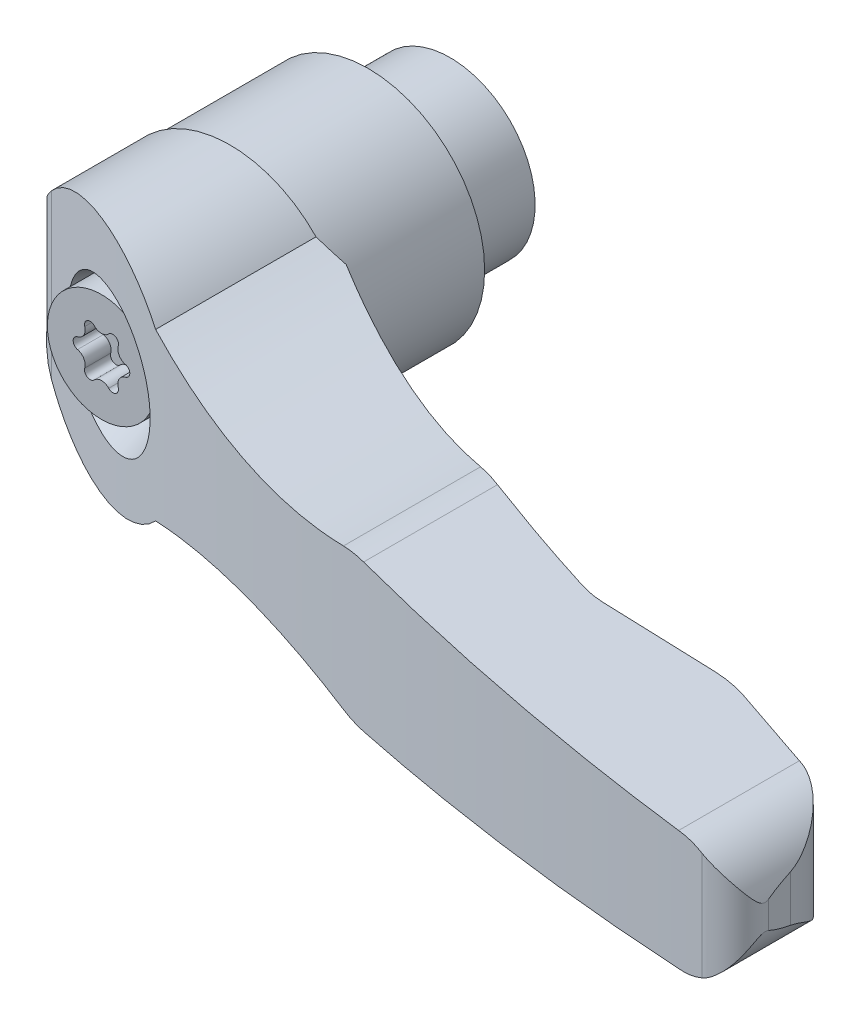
ISO-10303-21;
HEADER;
FILE_DESCRIPTION(('STEP AP214'),'2;1');
FILE_NAME('part.step','',(''),(''),'','','');
FILE_SCHEMA(('AUTOMOTIVE_DESIGN { 1 0 10303 214 1 1 1 1 }'));
ENDSEC;
DATA;
#1=APPLICATION_CONTEXT('core data for automotive mechanical design processes');
#2=APPLICATION_PROTOCOL_DEFINITION('international standard','automotive_design',2000,#1);
#3=PRODUCT_CONTEXT('',#1,'mechanical');
#4=PRODUCT('Part','Part','',(#3));
#5=PRODUCT_RELATED_PRODUCT_CATEGORY('part','',(#4));
#6=PRODUCT_DEFINITION_FORMATION('','',#4);
#7=PRODUCT_DEFINITION_CONTEXT('part definition',#1,'design');
#8=PRODUCT_DEFINITION('design','',#6,#7);
#9=PRODUCT_DEFINITION_SHAPE('','',#8);
#10=(LENGTH_UNIT() NAMED_UNIT(*) SI_UNIT(.MILLI.,.METRE.));
#11=(NAMED_UNIT(*) PLANE_ANGLE_UNIT() SI_UNIT($,.RADIAN.));
#12=(NAMED_UNIT(*) SI_UNIT($,.STERADIAN.) SOLID_ANGLE_UNIT());
#13=UNCERTAINTY_MEASURE_WITH_UNIT(LENGTH_MEASURE(1.E-05),#10,'distance_accuracy_value','');
#14=(GEOMETRIC_REPRESENTATION_CONTEXT(3) GLOBAL_UNCERTAINTY_ASSIGNED_CONTEXT((#13)) GLOBAL_UNIT_ASSIGNED_CONTEXT((#10,
#11,#12)) REPRESENTATION_CONTEXT('',''));
#15=CARTESIAN_POINT('',(0.,0.,0.));
#16=DIRECTION('',(0.,0.,1.));
#17=DIRECTION('',(1.,0.,0.));
#18=AXIS2_PLACEMENT_3D('',#15,#16,#17);
#19=CARTESIAN_POINT('',(-1.94278209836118,0.60205052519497,25.64));
#20=DIRECTION('',(0.,0.,-1.));
#21=DIRECTION('',(0.,1.,0.));
#22=AXIS2_PLACEMENT_3D('',#19,#20,#21);
#23=PLANE('',#22);
#24=CARTESIAN_POINT('',(-2.08556419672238,1.20410105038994,25.64));
#25=DIRECTION('',(0.,0.,-1.));
#26=DIRECTION('',(-1.,0.,0.));
#27=AXIS2_PLACEMENT_3D('',#24,#25,#26);
#28=CIRCLE('',#27,0.787499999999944);
#29=CARTESIAN_POINT('',(-1.33111425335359,1.4298476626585,25.64));
#30=VERTEX_POINT('',#29);
#31=CARTESIAN_POINT('',(-1.90384152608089,0.437854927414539,25.64));
#32=VERTEX_POINT('',#31);
#33=EDGE_CURVE('E641',#30,#32,#28,.T.);
#34=ORIENTED_EDGE('',*,*,#33,.T.);
#35=CARTESIAN_POINT('',(-1.8,0.,25.64));
#36=DIRECTION('',(0.,0.,1.));
#37=DIRECTION('',(1.,0.,0.));
#38=AXIS2_PLACEMENT_3D('',#35,#36,#37);
#39=CIRCLE('',#38,0.45);
#40=CARTESIAN_POINT('',(-1.90384152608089,-0.437854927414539,25.64));
#41=VERTEX_POINT('',#40);
#42=EDGE_CURVE('E645',#32,#41,#39,.T.);
#43=ORIENTED_EDGE('',*,*,#42,.T.);
#44=CARTESIAN_POINT('',(-2.08556419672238,-1.20410105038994,25.64));
#45=DIRECTION('',(0.,0.,-1.));
#46=DIRECTION('',(-1.,0.,0.));
#47=AXIS2_PLACEMENT_3D('',#44,#45,#46);
#48=CIRCLE('',#47,0.787499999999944);
#49=CARTESIAN_POINT('',(-1.33111425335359,-1.4298476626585,25.64));
#50=VERTEX_POINT('',#49);
#51=EDGE_CURVE('E682',#41,#50,#48,.T.);
#52=ORIENTED_EDGE('',*,*,#51,.T.);
#53=CARTESIAN_POINT('',(-0.899999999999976,-1.55884572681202,25.64));
#54=DIRECTION('',(0.,0.,1.));
#55=DIRECTION('',(1.,0.,0.));
#56=AXIS2_PLACEMENT_3D('',#53,#54,#55);
#57=CIRCLE('',#56,0.45);
#58=CARTESIAN_POINT('',(-0.57272727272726,-1.8677025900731,25.64));
#59=VERTEX_POINT('',#58);
#60=EDGE_CURVE('E678',#50,#59,#57,.T.);
#61=ORIENTED_EDGE('',*,*,#60,.T.);
#62=CARTESIAN_POINT('',(0.,-2.40820210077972,25.64));
#63=DIRECTION('',(0.,0.,-1.));
#64=DIRECTION('',(-1.,0.,0.));
#65=AXIS2_PLACEMENT_3D('',#62,#63,#64);
#66=CIRCLE('',#65,0.787499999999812);
#67=CARTESIAN_POINT('',(0.572727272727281,-1.8677025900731,25.64));
#68=VERTEX_POINT('',#67);
#69=EDGE_CURVE('E674',#59,#68,#66,.T.);
#70=ORIENTED_EDGE('',*,*,#69,.T.);
#71=CARTESIAN_POINT('',(0.9,-1.55884572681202,25.64));
#72=DIRECTION('',(0.,0.,1.));
#73=DIRECTION('',(-1.,0.,0.));
#74=AXIS2_PLACEMENT_3D('',#71,#72,#73);
#75=CIRCLE('',#74,0.45);
#76=CARTESIAN_POINT('',(1.33111425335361,-1.4298476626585,25.64));
#77=VERTEX_POINT('',#76);
#78=EDGE_CURVE('E670',#68,#77,#75,.T.);
#79=ORIENTED_EDGE('',*,*,#78,.T.);
#80=CARTESIAN_POINT('',(2.08556419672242,-1.20410105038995,25.64));
#81=DIRECTION('',(0.,0.,-1.));
#82=DIRECTION('',(1.,0.,0.));
#83=AXIS2_PLACEMENT_3D('',#80,#81,#82);
#84=CIRCLE('',#83,0.787499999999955);
#85=CARTESIAN_POINT('',(1.9038415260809,-0.437854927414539,25.64));
#86=VERTEX_POINT('',#85);
#87=EDGE_CURVE('E666',#77,#86,#84,.T.);
#88=ORIENTED_EDGE('',*,*,#87,.T.);
#89=CARTESIAN_POINT('',(1.8,0.,25.64));
#90=DIRECTION('',(0.,0.,1.));
#91=DIRECTION('',(-1.,0.,0.));
#92=AXIS2_PLACEMENT_3D('',#89,#90,#91);
#93=CIRCLE('',#92,0.45);
#94=CARTESIAN_POINT('',(1.9038415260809,0.437854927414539,25.64));
#95=VERTEX_POINT('',#94);
#96=EDGE_CURVE('E662',#86,#95,#93,.T.);
#97=ORIENTED_EDGE('',*,*,#96,.T.);
#98=CARTESIAN_POINT('',(2.08556419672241,1.20410105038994,25.64));
#99=DIRECTION('',(0.,0.,-1.));
#100=DIRECTION('',(1.,0.,0.));
#101=AXIS2_PLACEMENT_3D('',#98,#99,#100);
#102=CIRCLE('',#101,0.787499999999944);
#103=CARTESIAN_POINT('',(1.33111425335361,1.4298476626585,25.64));
#104=VERTEX_POINT('',#103);
#105=EDGE_CURVE('E658',#95,#104,#102,.T.);
#106=ORIENTED_EDGE('',*,*,#105,.T.);
#107=CARTESIAN_POINT('',(0.9,1.55884572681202,25.64));
#108=DIRECTION('',(0.,0.,1.));
#109=DIRECTION('',(-1.,0.,0.));
#110=AXIS2_PLACEMENT_3D('',#107,#108,#109);
#111=CIRCLE('',#110,0.45);
#112=CARTESIAN_POINT('',(0.572727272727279,1.8677025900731,25.64));
#113=VERTEX_POINT('',#112);
#114=EDGE_CURVE('E654',#104,#113,#111,.T.);
#115=ORIENTED_EDGE('',*,*,#114,.T.);
#116=CARTESIAN_POINT('',(0.,2.40820210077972,25.64));
#117=DIRECTION('',(0.,0.,-1.));
#118=DIRECTION('',(-1.,0.,0.));
#119=AXIS2_PLACEMENT_3D('',#116,#117,#118);
#120=CIRCLE('',#119,0.787499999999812);
#121=CARTESIAN_POINT('',(-0.572727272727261,1.8677025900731,25.64));
#122=VERTEX_POINT('',#121);
#123=EDGE_CURVE('E650',#113,#122,#120,.T.);
#124=ORIENTED_EDGE('',*,*,#123,.T.);
#125=CARTESIAN_POINT('',(-0.899999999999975,1.55884572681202,25.64));
#126=DIRECTION('',(0.,0.,1.));
#127=DIRECTION('',(1.,0.,0.));
#128=AXIS2_PLACEMENT_3D('',#125,#126,#127);
#129=CIRCLE('',#128,0.45);
#130=EDGE_CURVE('E640',#122,#30,#129,.T.);
#131=ORIENTED_EDGE('',*,*,#130,.T.);
#132=EDGE_LOOP('',(#34,#43,#52,#61,#70,#79,#88,#97,#106,#115,#124,#131));
#133=FACE_BOUND('',#132,.T.);
#134=ADVANCED_FACE('F14',(#133),#23,.F.);
#135=CARTESIAN_POINT('',(-2.08556419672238,-1.20410105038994,29.76));
#136=DIRECTION('',(0.,0.,-1.));
#137=DIRECTION('',(0.,1.,0.));
#138=AXIS2_PLACEMENT_3D('',#135,#136,#137);
#139=CYLINDRICAL_SURFACE('',#138,0.787499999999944);
#140=DIRECTION('',(0.,0.,-1.));
#141=VECTOR('',#140,1.);
#142=CARTESIAN_POINT('',(-1.33111425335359,-1.4298476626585,29.76));
#143=LINE('',#142,#141);
#144=CARTESIAN_POINT('',(-1.33111425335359,-1.4298476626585,27.7));
#145=VERTEX_POINT('',#144);
#146=EDGE_CURVE('E621',#145,#50,#143,.T.);
#147=ORIENTED_EDGE('',*,*,#146,.T.);
#148=ORIENTED_EDGE('',*,*,#51,.F.);
#149=DIRECTION('',(0.,0.,-1.));
#150=VECTOR('',#149,1.);
#151=CARTESIAN_POINT('',(-1.90384152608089,-0.437854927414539,29.76));
#152=LINE('',#151,#150);
#153=CARTESIAN_POINT('',(-1.90384152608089,-0.437854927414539,27.7));
#154=VERTEX_POINT('',#153);
#155=EDGE_CURVE('E619',#154,#41,#152,.T.);
#156=ORIENTED_EDGE('',*,*,#155,.F.);
#157=CARTESIAN_POINT('',(-2.08556419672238,-1.20410105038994,27.7));
#158=DIRECTION('',(0.,0.,1.));
#159=DIRECTION('',(0.,-1.,0.));
#160=AXIS2_PLACEMENT_3D('',#157,#158,#159);
#161=CIRCLE('',#160,0.787499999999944);
#162=EDGE_CURVE('E585',#145,#154,#161,.T.);
#163=ORIENTED_EDGE('',*,*,#162,.F.);
#164=EDGE_LOOP('',(#147,#148,#156,#163));
#165=FACE_BOUND('',#164,.T.);
#166=ADVANCED_FACE('F695',(#165),#139,.T.);
#167=CARTESIAN_POINT('',(-0.899999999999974,-1.55884572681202,29.76));
#168=DIRECTION('',(0.,0.,-1.));
#169=DIRECTION('',(0.,1.,0.));
#170=AXIS2_PLACEMENT_3D('',#167,#168,#169);
#171=CYLINDRICAL_SURFACE('',#170,0.45);
#172=DIRECTION('',(0.,0.,-1.));
#173=VECTOR('',#172,1.);
#174=CARTESIAN_POINT('',(-0.572727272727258,-1.8677025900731,29.76));
#175=LINE('',#174,#173);
#176=CARTESIAN_POINT('',(-0.572727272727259,-1.8677025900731,27.7));
#177=VERTEX_POINT('',#176);
#178=EDGE_CURVE('E623',#177,#59,#175,.T.);
#179=ORIENTED_EDGE('',*,*,#178,.T.);
#180=ORIENTED_EDGE('',*,*,#60,.F.);
#181=ORIENTED_EDGE('',*,*,#146,.F.);
#182=CARTESIAN_POINT('',(-0.899999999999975,-1.55884572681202,27.7));
#183=DIRECTION('',(0.,0.,1.));
#184=DIRECTION('',(0.,-1.,0.));
#185=AXIS2_PLACEMENT_3D('',#182,#183,#184);
#186=CIRCLE('',#185,0.45);
#187=EDGE_CURVE('E589',#177,#145,#186,.F.);
#188=ORIENTED_EDGE('',*,*,#187,.F.);
#189=EDGE_LOOP('',(#179,#180,#181,#188));
#190=FACE_BOUND('',#189,.T.);
#191=ADVANCED_FACE('F698',(#190),#171,.F.);
#192=CARTESIAN_POINT('',(0.,-2.40820210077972,29.76));
#193=DIRECTION('',(0.,0.,-1.));
#194=DIRECTION('',(0.,1.,0.));
#195=AXIS2_PLACEMENT_3D('',#192,#193,#194);
#196=CYLINDRICAL_SURFACE('',#195,0.787499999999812);
#197=DIRECTION('',(0.,0.,-1.));
#198=VECTOR('',#197,1.);
#199=CARTESIAN_POINT('',(0.572727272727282,-1.8677025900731,29.76));
#200=LINE('',#199,#198);
#201=CARTESIAN_POINT('',(0.572727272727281,-1.8677025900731,27.7));
#202=VERTEX_POINT('',#201);
#203=EDGE_CURVE('E625',#202,#68,#200,.T.);
#204=ORIENTED_EDGE('',*,*,#203,.T.);
#205=ORIENTED_EDGE('',*,*,#69,.F.);
#206=ORIENTED_EDGE('',*,*,#178,.F.);
#207=CARTESIAN_POINT('',(0.,-2.40820210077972,27.7));
#208=DIRECTION('',(0.,0.,1.));
#209=DIRECTION('',(0.,-1.,0.));
#210=AXIS2_PLACEMENT_3D('',#207,#208,#209);
#211=CIRCLE('',#210,0.787499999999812);
#212=EDGE_CURVE('E593',#202,#177,#211,.T.);
#213=ORIENTED_EDGE('',*,*,#212,.F.);
#214=EDGE_LOOP('',(#204,#205,#206,#213));
#215=FACE_BOUND('',#214,.T.);
#216=ADVANCED_FACE('F702',(#215),#196,.T.);
#217=CARTESIAN_POINT('',(0.9,-1.55884572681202,29.76));
#218=DIRECTION('',(0.,0.,-1.));
#219=DIRECTION('',(0.,1.,0.));
#220=AXIS2_PLACEMENT_3D('',#217,#218,#219);
#221=CYLINDRICAL_SURFACE('',#220,0.45);
#222=DIRECTION('',(0.,0.,-1.));
#223=VECTOR('',#222,1.);
#224=CARTESIAN_POINT('',(1.33111425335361,-1.4298476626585,29.76));
#225=LINE('',#224,#223);
#226=CARTESIAN_POINT('',(1.33111425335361,-1.4298476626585,27.7));
#227=VERTEX_POINT('',#226);
#228=EDGE_CURVE('E627',#227,#77,#225,.T.);
#229=ORIENTED_EDGE('',*,*,#228,.T.);
#230=ORIENTED_EDGE('',*,*,#78,.F.);
#231=ORIENTED_EDGE('',*,*,#203,.F.);
#232=CARTESIAN_POINT('',(0.9,-1.55884572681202,27.7));
#233=DIRECTION('',(0.,0.,1.));
#234=DIRECTION('',(0.,-1.,0.));
#235=AXIS2_PLACEMENT_3D('',#232,#233,#234);
#236=CIRCLE('',#235,0.45);
#237=EDGE_CURVE('E596',#227,#202,#236,.F.);
#238=ORIENTED_EDGE('',*,*,#237,.F.);
#239=EDGE_LOOP('',(#229,#230,#231,#238));
#240=FACE_BOUND('',#239,.T.);
#241=ADVANCED_FACE('F706',(#240),#221,.F.);
#242=CARTESIAN_POINT('',(2.08556419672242,-1.20410105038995,29.76));
#243=DIRECTION('',(0.,0.,-1.));
#244=DIRECTION('',(0.,1.,0.));
#245=AXIS2_PLACEMENT_3D('',#242,#243,#244);
#246=CYLINDRICAL_SURFACE('',#245,0.787499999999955);
#247=DIRECTION('',(0.,0.,-1.));
#248=VECTOR('',#247,1.);
#249=CARTESIAN_POINT('',(1.9038415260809,-0.437854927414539,29.76));
#250=LINE('',#249,#248);
#251=CARTESIAN_POINT('',(1.9038415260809,-0.437854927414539,27.7));
#252=VERTEX_POINT('',#251);
#253=EDGE_CURVE('E629',#252,#86,#250,.T.);
#254=ORIENTED_EDGE('',*,*,#253,.T.);
#255=ORIENTED_EDGE('',*,*,#87,.F.);
#256=ORIENTED_EDGE('',*,*,#228,.F.);
#257=CARTESIAN_POINT('',(2.08556419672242,-1.20410105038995,27.7));
#258=DIRECTION('',(0.,0.,1.));
#259=DIRECTION('',(0.,-1.,0.));
#260=AXIS2_PLACEMENT_3D('',#257,#258,#259);
#261=CIRCLE('',#260,0.787499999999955);
#262=EDGE_CURVE('E599',#252,#227,#261,.T.);
#263=ORIENTED_EDGE('',*,*,#262,.F.);
#264=EDGE_LOOP('',(#254,#255,#256,#263));
#265=FACE_BOUND('',#264,.T.);
#266=ADVANCED_FACE('F711',(#265),#246,.T.);
#267=CARTESIAN_POINT('',(1.8,0.,29.76));
#268=DIRECTION('',(0.,0.,-1.));
#269=DIRECTION('',(0.,1.,0.));
#270=AXIS2_PLACEMENT_3D('',#267,#268,#269);
#271=CYLINDRICAL_SURFACE('',#270,0.45);
#272=DIRECTION('',(0.,0.,-1.));
#273=VECTOR('',#272,1.);
#274=CARTESIAN_POINT('',(1.90384152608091,0.437854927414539,29.76));
#275=LINE('',#274,#273);
#276=CARTESIAN_POINT('',(1.9038415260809,0.437854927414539,27.7));
#277=VERTEX_POINT('',#276);
#278=EDGE_CURVE('E631',#277,#95,#275,.T.);
#279=ORIENTED_EDGE('',*,*,#278,.T.);
#280=ORIENTED_EDGE('',*,*,#96,.F.);
#281=ORIENTED_EDGE('',*,*,#253,.F.);
#282=CARTESIAN_POINT('',(1.8,0.,27.7));
#283=DIRECTION('',(0.,0.,1.));
#284=DIRECTION('',(0.,-1.,0.));
#285=AXIS2_PLACEMENT_3D('',#282,#283,#284);
#286=CIRCLE('',#285,0.45);
#287=EDGE_CURVE('E602',#277,#252,#286,.F.);
#288=ORIENTED_EDGE('',*,*,#287,.F.);
#289=EDGE_LOOP('',(#279,#280,#281,#288));
#290=FACE_BOUND('',#289,.T.);
#291=ADVANCED_FACE('F714',(#290),#271,.F.);
#292=CARTESIAN_POINT('',(2.08556419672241,1.20410105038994,29.76));
#293=DIRECTION('',(0.,0.,-1.));
#294=DIRECTION('',(0.,1.,0.));
#295=AXIS2_PLACEMENT_3D('',#292,#293,#294);
#296=CYLINDRICAL_SURFACE('',#295,0.787499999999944);
#297=DIRECTION('',(0.,0.,-1.));
#298=VECTOR('',#297,1.);
#299=CARTESIAN_POINT('',(1.33111425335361,1.4298476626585,29.76));
#300=LINE('',#299,#298);
#301=CARTESIAN_POINT('',(1.33111425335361,1.4298476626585,27.7));
#302=VERTEX_POINT('',#301);
#303=EDGE_CURVE('E633',#302,#104,#300,.T.);
#304=ORIENTED_EDGE('',*,*,#303,.T.);
#305=ORIENTED_EDGE('',*,*,#105,.F.);
#306=ORIENTED_EDGE('',*,*,#278,.F.);
#307=CARTESIAN_POINT('',(2.08556419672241,1.20410105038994,27.7));
#308=DIRECTION('',(0.,0.,1.));
#309=DIRECTION('',(0.,-1.,0.));
#310=AXIS2_PLACEMENT_3D('',#307,#308,#309);
#311=CIRCLE('',#310,0.787499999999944);
#312=EDGE_CURVE('E605',#302,#277,#311,.T.);
#313=ORIENTED_EDGE('',*,*,#312,.F.);
#314=EDGE_LOOP('',(#304,#305,#306,#313));
#315=FACE_BOUND('',#314,.T.);
#316=ADVANCED_FACE('F718',(#315),#296,.T.);
#317=CARTESIAN_POINT('',(0.9,1.55884572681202,29.76));
#318=DIRECTION('',(0.,0.,-1.));
#319=DIRECTION('',(0.,1.,0.));
#320=AXIS2_PLACEMENT_3D('',#317,#318,#319);
#321=CYLINDRICAL_SURFACE('',#320,0.45);
#322=DIRECTION('',(0.,0.,-1.));
#323=VECTOR('',#322,1.);
#324=CARTESIAN_POINT('',(0.57272727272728,1.8677025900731,29.76));
#325=LINE('',#324,#323);
#326=CARTESIAN_POINT('',(0.57272727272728,1.8677025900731,27.7));
#327=VERTEX_POINT('',#326);
#328=EDGE_CURVE('E635',#327,#113,#325,.T.);
#329=ORIENTED_EDGE('',*,*,#328,.T.);
#330=ORIENTED_EDGE('',*,*,#114,.F.);
#331=ORIENTED_EDGE('',*,*,#303,.F.);
#332=CARTESIAN_POINT('',(0.9,1.55884572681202,27.7));
#333=DIRECTION('',(0.,0.,1.));
#334=DIRECTION('',(0.,-1.,0.));
#335=AXIS2_PLACEMENT_3D('',#332,#333,#334);
#336=CIRCLE('',#335,0.45);
#337=EDGE_CURVE('E608',#327,#302,#336,.F.);
#338=ORIENTED_EDGE('',*,*,#337,.F.);
#339=EDGE_LOOP('',(#329,#330,#331,#338));
#340=FACE_BOUND('',#339,.T.);
#341=ADVANCED_FACE('F722',(#340),#321,.F.);
#342=CARTESIAN_POINT('',(0.,2.40820210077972,29.76));
#343=DIRECTION('',(0.,0.,-1.));
#344=DIRECTION('',(0.,1.,0.));
#345=AXIS2_PLACEMENT_3D('',#342,#343,#344);
#346=CYLINDRICAL_SURFACE('',#345,0.787499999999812);
#347=DIRECTION('',(0.,0.,-1.));
#348=VECTOR('',#347,1.);
#349=CARTESIAN_POINT('',(-0.57272727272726,1.8677025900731,29.76));
#350=LINE('',#349,#348);
#351=CARTESIAN_POINT('',(-0.57272727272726,1.8677025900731,27.7));
#352=VERTEX_POINT('',#351);
#353=EDGE_CURVE('E113',#352,#122,#350,.T.);
#354=ORIENTED_EDGE('',*,*,#353,.T.);
#355=ORIENTED_EDGE('',*,*,#123,.F.);
#356=ORIENTED_EDGE('',*,*,#328,.F.);
#357=CARTESIAN_POINT('',(0.,2.40820210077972,27.7));
#358=DIRECTION('',(0.,0.,1.));
#359=DIRECTION('',(0.,-1.,0.));
#360=AXIS2_PLACEMENT_3D('',#357,#358,#359);
#361=CIRCLE('',#360,0.787499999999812);
#362=EDGE_CURVE('E611',#352,#327,#361,.T.);
#363=ORIENTED_EDGE('',*,*,#362,.F.);
#364=EDGE_LOOP('',(#354,#355,#356,#363));
#365=FACE_BOUND('',#364,.T.);
#366=ADVANCED_FACE('F726',(#365),#346,.T.);
#367=CARTESIAN_POINT('',(-0.899999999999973,1.55884572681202,29.76));
#368=DIRECTION('',(0.,0.,-1.));
#369=DIRECTION('',(0.,1.,0.));
#370=AXIS2_PLACEMENT_3D('',#367,#368,#369);
#371=CYLINDRICAL_SURFACE('',#370,0.45);
#372=DIRECTION('',(0.,0.,-1.));
#373=VECTOR('',#372,1.);
#374=CARTESIAN_POINT('',(-1.33111425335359,1.4298476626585,29.76));
#375=LINE('',#374,#373);
#376=CARTESIAN_POINT('',(-1.33111425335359,1.4298476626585,27.7));
#377=VERTEX_POINT('',#376);
#378=EDGE_CURVE('E638',#377,#30,#375,.T.);
#379=ORIENTED_EDGE('',*,*,#378,.T.);
#380=ORIENTED_EDGE('',*,*,#130,.F.);
#381=ORIENTED_EDGE('',*,*,#353,.F.);
#382=CARTESIAN_POINT('',(-0.899999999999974,1.55884572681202,27.7));
#383=DIRECTION('',(0.,0.,1.));
#384=DIRECTION('',(0.,-1.,0.));
#385=AXIS2_PLACEMENT_3D('',#382,#383,#384);
#386=CIRCLE('',#385,0.45);
#387=EDGE_CURVE('E614',#377,#352,#386,.F.);
#388=ORIENTED_EDGE('',*,*,#387,.F.);
#389=EDGE_LOOP('',(#379,#380,#381,#388));
#390=FACE_BOUND('',#389,.T.);
#391=ADVANCED_FACE('F727',(#390),#371,.F.);
#392=CARTESIAN_POINT('',(-2.08556419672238,1.20410105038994,29.76));
#393=DIRECTION('',(0.,0.,-1.));
#394=DIRECTION('',(0.,1.,0.));
#395=AXIS2_PLACEMENT_3D('',#392,#393,#394);
#396=CYLINDRICAL_SURFACE('',#395,0.787499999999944);
#397=DIRECTION('',(0.,0.,-1.));
#398=VECTOR('',#397,1.);
#399=CARTESIAN_POINT('',(-1.90384152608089,0.437854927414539,29.76));
#400=LINE('',#399,#398);
#401=CARTESIAN_POINT('',(-1.90384152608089,0.437854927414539,27.7));
#402=VERTEX_POINT('',#401);
#403=EDGE_CURVE('E617',#402,#32,#400,.T.);
#404=ORIENTED_EDGE('',*,*,#403,.T.);
#405=ORIENTED_EDGE('',*,*,#33,.F.);
#406=ORIENTED_EDGE('',*,*,#378,.F.);
#407=CARTESIAN_POINT('',(-2.08556419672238,1.20410105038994,27.7));
#408=DIRECTION('',(0.,0.,1.));
#409=DIRECTION('',(0.,-1.,0.));
#410=AXIS2_PLACEMENT_3D('',#407,#408,#409);
#411=CIRCLE('',#410,0.787499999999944);
#412=EDGE_CURVE('E107',#402,#377,#411,.T.);
#413=ORIENTED_EDGE('',*,*,#412,.F.);
#414=EDGE_LOOP('',(#404,#405,#406,#413));
#415=FACE_BOUND('',#414,.T.);
#416=ADVANCED_FACE('F573',(#415),#396,.T.);
#417=CARTESIAN_POINT('',(-1.8,0.,29.76));
#418=DIRECTION('',(0.,0.,-1.));
#419=DIRECTION('',(0.,1.,0.));
#420=AXIS2_PLACEMENT_3D('',#417,#418,#419);
#421=CYLINDRICAL_SURFACE('',#420,0.45);
#422=ORIENTED_EDGE('',*,*,#155,.T.);
#423=ORIENTED_EDGE('',*,*,#42,.F.);
#424=ORIENTED_EDGE('',*,*,#403,.F.);
#425=CARTESIAN_POINT('',(-1.8,0.,27.7));
#426=DIRECTION('',(0.,0.,1.));
#427=DIRECTION('',(0.,-1.,0.));
#428=AXIS2_PLACEMENT_3D('',#425,#426,#427);
#429=CIRCLE('',#428,0.45);
#430=EDGE_CURVE('E582',#154,#402,#429,.F.);
#431=ORIENTED_EDGE('',*,*,#430,.F.);
#432=EDGE_LOOP('',(#422,#423,#424,#431));
#433=FACE_BOUND('',#432,.T.);
#434=ADVANCED_FACE('F568',(#433),#421,.F.);
#435=CARTESIAN_POINT('',(0.,0.,27.7));
#436=DIRECTION('',(0.,0.,1.));
#437=DIRECTION('',(0.,-1.,0.));
#438=AXIS2_PLACEMENT_3D('',#435,#436,#437);
#439=PLANE('',#438);
#440=CARTESIAN_POINT('',(0.,0.,27.7));
#441=DIRECTION('',(0.,0.,1.));
#442=DIRECTION('',(0.,-1.,0.));
#443=AXIS2_PLACEMENT_3D('',#440,#441,#442);
#444=CIRCLE('',#443,4.3);
#445=CARTESIAN_POINT('',(0.,-4.3,27.7));
#446=VERTEX_POINT('',#445);
#447=EDGE_CURVE('E579',#446,#446,#444,.T.);
#448=ORIENTED_EDGE('',*,*,#447,.T.);
#449=EDGE_LOOP('',(#448));
#450=FACE_BOUND('',#449,.T.);
#451=ORIENTED_EDGE('',*,*,#430,.T.);
#452=ORIENTED_EDGE('',*,*,#412,.T.);
#453=ORIENTED_EDGE('',*,*,#387,.T.);
#454=ORIENTED_EDGE('',*,*,#362,.T.);
#455=ORIENTED_EDGE('',*,*,#337,.T.);
#456=ORIENTED_EDGE('',*,*,#312,.T.);
#457=ORIENTED_EDGE('',*,*,#287,.T.);
#458=ORIENTED_EDGE('',*,*,#262,.T.);
#459=ORIENTED_EDGE('',*,*,#237,.T.);
#460=ORIENTED_EDGE('',*,*,#212,.T.);
#461=ORIENTED_EDGE('',*,*,#187,.T.);
#462=ORIENTED_EDGE('',*,*,#162,.T.);
#463=EDGE_LOOP('',(#451,#452,#453,#454,#455,#456,#457,#458,#459,#460,#461,#462));
#464=FACE_BOUND('',#463,.T.);
#465=ADVANCED_FACE('F16',(#450,#464),#439,.T.);
#466=CARTESIAN_POINT('',(58.6337202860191,-10.5,38.3283479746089));
#467=DIRECTION('',(0.,1.,0.));
#468=DIRECTION('',(-1.,0.,0.));
#469=AXIS2_PLACEMENT_3D('',#466,#467,#468);
#470=CYLINDRICAL_SURFACE('',#469,6.04000000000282);
#471=CARTESIAN_POINT('',(60.447972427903,-4.74587261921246,32.5672639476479));
#472=CARTESIAN_POINT('',(60.5755504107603,-4.74057354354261,32.6074069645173));
#473=CARTESIAN_POINT('',(60.7015088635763,-4.73014540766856,32.6517620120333));
#474=CARTESIAN_POINT('',(60.9490652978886,-4.69992242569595,32.7481786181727));
#475=CARTESIAN_POINT('',(61.0706698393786,-4.68014236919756,32.8002279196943));
#476=CARTESIAN_POINT('',(61.3074659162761,-4.63235500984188,32.9108206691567));
#477=CARTESIAN_POINT('',(61.4227141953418,-4.6044427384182,32.9692844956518));
#478=CARTESIAN_POINT('',(61.647717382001,-4.54120548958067,33.0925213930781));
#479=CARTESIAN_POINT('',(61.7574696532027,-4.50587699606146,33.1572974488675));
#480=CARTESIAN_POINT('',(61.9940137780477,-4.42040174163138,33.307032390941));
#481=CARTESIAN_POINT('',(62.1193938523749,-4.36870213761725,33.3933358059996));
#482=CARTESIAN_POINT('',(62.3610721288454,-4.25718277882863,33.5732278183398));
#483=CARTESIAN_POINT('',(62.4773638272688,-4.19735729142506,33.666821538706));
#484=CARTESIAN_POINT('',(62.7012840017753,-4.07066877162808,33.8608437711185));
#485=CARTESIAN_POINT('',(62.8088611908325,-4.00376876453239,33.961307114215));
#486=CARTESIAN_POINT('',(63.0146476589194,-3.86453813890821,34.1677809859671));
#487=CARTESIAN_POINT('',(63.1128596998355,-3.79220913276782,34.2737898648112));
#488=CARTESIAN_POINT('',(63.3331746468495,-3.61700510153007,34.5290929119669));
#489=CARTESIAN_POINT('',(63.4514763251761,-3.51235864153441,34.6804594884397));
#490=CARTESIAN_POINT('',(63.6718053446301,-3.29808480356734,34.9913387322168));
#491=CARTESIAN_POINT('',(63.7738256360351,-3.1884552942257,35.1508548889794));
#492=CARTESIAN_POINT('',(63.9616621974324,-2.96765680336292,35.4770445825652));
#493=CARTESIAN_POINT('',(64.0475378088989,-2.85649513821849,35.6436890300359));
#494=CARTESIAN_POINT('',(64.2038484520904,-2.63586419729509,35.9851508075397));
#495=CARTESIAN_POINT('',(64.274287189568,-2.52639452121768,36.1599661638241));
#496=CARTESIAN_POINT('',(64.370584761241,-2.36382517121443,36.4361542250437));
#497=CARTESIAN_POINT('',(64.4019853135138,-2.30809068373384,36.5340606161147));
#498=CARTESIAN_POINT('',(64.4601539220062,-2.20019362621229,36.7330390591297));
#499=CARTESIAN_POINT('',(64.4869269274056,-2.14802727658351,36.8341075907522));
#500=CARTESIAN_POINT('',(64.5357331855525,-2.04890785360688,37.0402846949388));
#501=CARTESIAN_POINT('',(64.5577546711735,-2.00196785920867,37.1454025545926));
#502=CARTESIAN_POINT('',(64.5966140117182,-1.91618262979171,37.360168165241));
#503=CARTESIAN_POINT('',(64.6134353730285,-1.87736327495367,37.4698291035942));
#504=CARTESIAN_POINT('',(64.62740519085,-1.84413226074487,37.5817950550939));
#505=B_SPLINE_CURVE_WITH_KNOTS('',3,(#471,#472,#473,#474,#475,#476,#477,#478,#479,#480,#481,
#482,#483,#484,#485,#486,#487,#488,#489,#490,#491,#492,#493,#494,#495,#496,#497,#498,#499,#500,
#501,#502,#503,#504),.UNSPECIFIED.,.F.,.F.,(4,2,2,2,2,2,2,2,2,2,2,2,2,2,2,2,4),(0.,
0.401264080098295,0.801895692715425,1.19802151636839,1.59433557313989,2.07588331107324,
2.55777255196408,3.04231807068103,3.52672024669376,4.18208013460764,4.837723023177,
5.49090678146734,6.14393356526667,6.49464389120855,6.84497677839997,7.19616755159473,
7.54846105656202),.UNSPECIFIED.);
#506=CARTESIAN_POINT('',(60.447972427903,-4.74587261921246,32.5672639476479));
#507=VERTEX_POINT('',#506);
#508=CARTESIAN_POINT('',(64.62740519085,-1.84413226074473,37.5817950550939));
#509=VERTEX_POINT('',#508);
#510=EDGE_CURVE('E458',#507,#509,#505,.T.);
#511=ORIENTED_EDGE('',*,*,#510,.F.);
#512=DIRECTION('',(0.,1.,0.));
#513=VECTOR('',#512,1.);
#514=CARTESIAN_POINT('',(60.447972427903,-10.5,32.5672639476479));
#515=LINE('',#514,#513);
#516=CARTESIAN_POINT('',(60.447972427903,4.74587261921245,32.5672639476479));
#517=VERTEX_POINT('',#516);
#518=EDGE_CURVE('E289',#507,#517,#515,.T.);
#519=ORIENTED_EDGE('',*,*,#518,.T.);
#520=CARTESIAN_POINT('',(64.62740519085,1.84413226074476,37.5817950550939));
#521=CARTESIAN_POINT('',(64.6175868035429,1.86745330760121,37.5030045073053));
#522=CARTESIAN_POINT('',(64.6063375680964,1.89362327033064,37.4253204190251));
#523=CARTESIAN_POINT('',(64.5811702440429,1.95049016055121,37.2721928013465));
#524=CARTESIAN_POINT('',(64.5672561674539,1.98118026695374,37.1967460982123));
#525=CARTESIAN_POINT('',(64.5369883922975,2.04585034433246,37.0482136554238));
#526=CARTESIAN_POINT('',(64.520645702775,2.07981523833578,36.9751189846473));
#527=CARTESIAN_POINT('',(64.4855821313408,2.15032519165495,36.830739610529));
#528=CARTESIAN_POINT('',(64.4668602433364,2.18687133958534,36.75945568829));
#529=CARTESIAN_POINT('',(64.4072221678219,2.29938724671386,36.5479610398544));
#530=CARTESIAN_POINT('',(64.3628565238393,2.37818379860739,36.4102182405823));
#531=CARTESIAN_POINT('',(64.2652007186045,2.53960895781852,36.1400450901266));
#532=CARTESIAN_POINT('',(64.2118976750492,2.62224297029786,36.0076227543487));
#533=CARTESIAN_POINT('',(64.0771192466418,2.81672317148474,35.7040219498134));
#534=CARTESIAN_POINT('',(63.9921849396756,2.929092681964,35.5347005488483));
#535=CARTESIAN_POINT('',(63.8063278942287,3.1521662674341,35.2039790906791));
#536=CARTESIAN_POINT('',(63.7054078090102,3.26287061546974,35.0425777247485));
#537=CARTESIAN_POINT('',(63.4870671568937,3.4795902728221,34.7278934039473));
#538=CARTESIAN_POINT('',(63.3696459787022,3.58560540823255,34.5746107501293));
#539=CARTESIAN_POINT('',(63.1179209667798,3.78996521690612,34.2772360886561));
#540=CARTESIAN_POINT('',(62.9836257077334,3.88831374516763,34.1331394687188));
#541=CARTESIAN_POINT('',(62.6561598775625,4.10136712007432,33.8153134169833));
#542=CARTESIAN_POINT('',(62.457188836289,4.21258905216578,33.6450495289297));
#543=CARTESIAN_POINT('',(62.1378586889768,4.36029911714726,33.406945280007));
#544=CARTESIAN_POINT('',(62.0281124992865,4.4062951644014,33.3305585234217));
#545=CARTESIAN_POINT('',(61.8018114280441,4.49098569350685,33.1841350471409));
#546=CARTESIAN_POINT('',(61.6852609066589,4.52968478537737,33.1140943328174));
#547=CARTESIAN_POINT('',(61.4786111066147,4.58924867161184,32.9993621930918));
#548=CARTESIAN_POINT('',(61.3900115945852,4.61209493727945,32.9529824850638));
#549=CARTESIAN_POINT('',(61.2097340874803,4.65295056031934,32.864298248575));
#550=CARTESIAN_POINT('',(61.1180570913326,4.67096147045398,32.8219924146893));
#551=CARTESIAN_POINT('',(60.9313596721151,4.70183469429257,32.7415027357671));
#552=CARTESIAN_POINT('',(60.8363219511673,4.71466416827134,32.7033462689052));
#553=CARTESIAN_POINT('',(60.643828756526,4.73463763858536,32.6317122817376));
#554=CARTESIAN_POINT('',(60.5463713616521,4.74177695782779,32.5982386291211));
#555=CARTESIAN_POINT('',(60.447972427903,4.74587261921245,32.5672639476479));
#556=B_SPLINE_CURVE_WITH_KNOTS('',3,(#520,#521,#522,#523,#524,#525,#526,#527,#528,#529,#530,
#531,#532,#533,#534,#535,#536,#537,#538,#539,#540,#541,#542,#543,#544,#545,#546,#547,#548,#549,
#550,#551,#552,#553,#554,#555),.UNSPECIFIED.,.F.,.F.,(4,2,2,2,2,2,2,2,2,2,2,2,2,2,2,2,2,4),(0.,
0.248076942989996,0.495783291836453,0.742399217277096,0.989119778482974,1.48293160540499,
1.97746142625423,2.63745339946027,3.29733594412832,3.95724294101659,4.61681594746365,
5.46693586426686,5.89075482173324,6.31430511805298,6.6218336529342,6.92926331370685,
7.23861197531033,7.54821464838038),.UNSPECIFIED.);
#557=CARTESIAN_POINT('',(64.62740519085,1.84413226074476,37.5817950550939));
#558=VERTEX_POINT('',#557);
#559=EDGE_CURVE('E443',#558,#517,#556,.T.);
#560=ORIENTED_EDGE('',*,*,#559,.F.);
#561=DIRECTION('',(0.,1.,0.));
#562=VECTOR('',#561,1.);
#563=CARTESIAN_POINT('',(64.62740519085,-10.5,37.5817950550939));
#564=LINE('',#563,#562);
#565=EDGE_CURVE('E286',#509,#558,#564,.T.);
#566=ORIENTED_EDGE('',*,*,#565,.F.);
#567=EDGE_LOOP('',(#511,#519,#560,#566));
#568=FACE_BOUND('',#567,.T.);
#569=ADVANCED_FACE('F467',(#568),#470,.T.);
#570=CARTESIAN_POINT('',(64.62740519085,-10.5,37.5817950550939));
#571=DIRECTION('',(-0.992331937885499,0.,0.123601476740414));
#572=DIRECTION('',(-0.123601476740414,0.,-0.992331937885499));
#573=AXIS2_PLACEMENT_3D('',#570,#571,#572);
#574=PLANE('',#573);
#575=CARTESIAN_POINT('',(60.25,0.,2.43788666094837));
#576=DIRECTION('',(-0.992331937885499,0.,0.123601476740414));
#577=DIRECTION('',(0.123601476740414,0.,0.992331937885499));
#578=AXIS2_PLACEMENT_3D('',#575,#576,#577);
#579=ELLIPSE('',#578,38.429961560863,4.75);
#580=CARTESIAN_POINT('',(64.8745408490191,1.08449155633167,39.5659186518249));
#581=VERTEX_POINT('',#580);
#582=EDGE_CURVE('E844',#581,#558,#579,.T.);
#583=ORIENTED_EDGE('',*,*,#582,.F.);
#584=DIRECTION('',(0.,1.,0.));
#585=VECTOR('',#584,1.);
#586=CARTESIAN_POINT('',(64.874540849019,-10.5,39.5659186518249));
#587=LINE('',#586,#585);
#588=CARTESIAN_POINT('',(64.874540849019,-1.08449155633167,39.5659186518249));
#589=VERTEX_POINT('',#588);
#590=EDGE_CURVE('E283',#589,#581,#587,.T.);
#591=ORIENTED_EDGE('',*,*,#590,.F.);
#592=EDGE_CURVE('E456',#509,#589,#579,.T.);
#593=ORIENTED_EDGE('',*,*,#592,.F.);
#594=ORIENTED_EDGE('',*,*,#565,.T.);
#595=EDGE_LOOP('',(#583,#591,#593,#594));
#596=FACE_BOUND('',#595,.T.);
#597=ADVANCED_FACE('F471',(#596),#574,.F.);
#598=CARTESIAN_POINT('',(0.,0.,6.5));
#599=DIRECTION('',(0.,0.,1.));
#600=DIRECTION('',(0.,-1.,0.));
#601=AXIS2_PLACEMENT_3D('',#598,#599,#600);
#602=CYLINDRICAL_SURFACE('',#601,4.3);
#603=CARTESIAN_POINT('',(0.,0.,24.9));
#604=DIRECTION('',(0.,0.,1.));
#605=DIRECTION('',(0.,-1.,0.));
#606=AXIS2_PLACEMENT_3D('',#603,#604,#605);
#607=CIRCLE('',#606,4.3);
#608=CARTESIAN_POINT('',(0.,-4.3,24.9));
#609=VERTEX_POINT('',#608);
#610=EDGE_CURVE('E588',#609,#609,#607,.T.);
#611=ORIENTED_EDGE('',*,*,#610,.T.);
#612=EDGE_LOOP('',(#611));
#613=FACE_BOUND('',#612,.T.);
#614=ORIENTED_EDGE('',*,*,#447,.F.);
#615=EDGE_LOOP('',(#614));
#616=FACE_BOUND('',#615,.T.);
#617=ADVANCED_FACE('F486',(#613,#616),#602,.T.);
#618=CARTESIAN_POINT('',(42.239481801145,-10.5,30.06));
#619=DIRECTION('',(0.,0.,1.));
#620=DIRECTION('',(0.,-1.,0.));
#621=AXIS2_PLACEMENT_3D('',#618,#619,#620);
#622=PLANE('',#621);
#623=DIRECTION('',(-0.999347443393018,0.0361204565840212,0.));
#624=VECTOR('',#623,1.);
#625=CARTESIAN_POINT('',(42.8134574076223,5.38022713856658,30.06));
#626=LINE('',#625,#624);
#627=CARTESIAN_POINT('',(51.078035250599,5.08151188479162,30.06));
#628=VERTEX_POINT('',#627);
#629=CARTESIAN_POINT('',(42.239481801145,5.40097293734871,30.06));
#630=VERTEX_POINT('',#629);
#631=EDGE_CURVE('E834',#628,#630,#626,.T.);
#632=ORIENTED_EDGE('',*,*,#631,.F.);
#633=DIRECTION('',(0.,1.,0.));
#634=VECTOR('',#633,1.);
#635=CARTESIAN_POINT('',(51.078035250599,-10.5,30.06));
#636=LINE('',#635,#634);
#637=CARTESIAN_POINT('',(51.078035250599,-5.08151188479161,30.06));
#638=VERTEX_POINT('',#637);
#639=EDGE_CURVE('E295',#638,#628,#636,.T.);
#640=ORIENTED_EDGE('',*,*,#639,.F.);
#641=DIRECTION('',(0.999347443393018,0.0361204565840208,0.));
#642=VECTOR('',#641,1.);
#643=CARTESIAN_POINT('',(42.0554228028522,-5.40762557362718,30.06));
#644=LINE('',#643,#642);
#645=CARTESIAN_POINT('',(42.239481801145,-5.40097293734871,30.06));
#646=VERTEX_POINT('',#645);
#647=EDGE_CURVE('E831',#646,#638,#644,.T.);
#648=ORIENTED_EDGE('',*,*,#647,.F.);
#649=DIRECTION('',(0.,1.,0.));
#650=VECTOR('',#649,1.);
#651=CARTESIAN_POINT('',(42.239481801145,-10.5,30.06));
#652=LINE('',#651,#650);
#653=EDGE_CURVE('E298',#646,#630,#652,.T.);
#654=ORIENTED_EDGE('',*,*,#653,.T.);
#655=EDGE_LOOP('',(#632,#640,#648,#654));
#656=FACE_BOUND('',#655,.T.);
#657=ADVANCED_FACE('F482',(#656),#622,.F.);
#658=CARTESIAN_POINT('',(51.0780352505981,-10.5,39.220000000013));
#659=DIRECTION('',(0.,1.,0.));
#660=DIRECTION('',(-1.,0.,0.));
#661=AXIS2_PLACEMENT_3D('',#658,#659,#660);
#662=CYLINDRICAL_SURFACE('',#661,9.16000000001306);
#663=CARTESIAN_POINT('',(51.0780352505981,5.08151188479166,39.220000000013));
#664=DIRECTION('',(0.0361204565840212,0.999347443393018,0.));
#665=DIRECTION('',(-0.999347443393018,0.0361204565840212,0.));
#666=AXIS2_PLACEMENT_3D('',#663,#664,#665);
#667=ELLIPSE('',#666,9.165981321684,9.16000000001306);
#668=CARTESIAN_POINT('',(53.829450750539,4.98206460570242,30.482991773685));
#669=VERTEX_POINT('',#668);
#670=EDGE_CURVE('E835',#669,#628,#667,.T.);
#671=ORIENTED_EDGE('',*,*,#670,.F.);
#672=DIRECTION('',(0.,1.,0.));
#673=VECTOR('',#672,1.);
#674=CARTESIAN_POINT('',(53.829450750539,-10.5,30.482991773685));
#675=LINE('',#674,#673);
#676=CARTESIAN_POINT('',(53.829450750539,-4.98206460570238,30.482991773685));
#677=VERTEX_POINT('',#676);
#678=EDGE_CURVE('E292',#677,#669,#675,.T.);
#679=ORIENTED_EDGE('',*,*,#678,.F.);
#680=CARTESIAN_POINT('',(51.0780352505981,-5.08151188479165,39.220000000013));
#681=DIRECTION('',(0.0361204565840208,-0.999347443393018,0.));
#682=DIRECTION('',(0.999347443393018,0.0361204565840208,0.));
#683=AXIS2_PLACEMENT_3D('',#680,#681,#682);
#684=ELLIPSE('',#683,9.165981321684,9.16000000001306);
#685=EDGE_CURVE('E859',#638,#677,#684,.T.);
#686=ORIENTED_EDGE('',*,*,#685,.F.);
#687=ORIENTED_EDGE('',*,*,#639,.T.);
#688=EDGE_LOOP('',(#671,#679,#686,#687));
#689=FACE_BOUND('',#688,.T.);
#690=ADVANCED_FACE('F478',(#689),#662,.T.);
#691=CARTESIAN_POINT('',(53.829450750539,-10.5,30.482991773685));
#692=DIRECTION('',(-0.300372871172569,0.,0.95382185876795));
#693=DIRECTION('',(-0.95382185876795,0.,-0.300372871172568));
#694=AXIS2_PLACEMENT_3D('',#691,#692,#693);
#695=PLANE('',#694);
#696=DIRECTION('',(-0.953255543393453,0.0344545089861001,-0.300194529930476));
#697=VECTOR('',#696,1.);
#698=CARTESIAN_POINT('',(54.3379429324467,4.96368564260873,30.6431236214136));
#699=LINE('',#698,#697);
#700=CARTESIAN_POINT('',(60.25,4.75,32.5049194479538));
#701=VERTEX_POINT('',#700);
#702=EDGE_CURVE('E465',#701,#669,#699,.T.);
#703=ORIENTED_EDGE('',*,*,#702,.F.);
#704=CARTESIAN_POINT('',(60.25,0.,32.5049194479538));
#705=DIRECTION('',(-0.300372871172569,0.,0.95382185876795));
#706=DIRECTION('',(0.95382185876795,0.,0.300372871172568));
#707=AXIS2_PLACEMENT_3D('',#704,#705,#706);
#708=ELLIPSE('',#707,4.97996555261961,4.75);
#709=EDGE_CURVE('E457',#517,#701,#708,.T.);
#710=ORIENTED_EDGE('',*,*,#709,.F.);
#711=ORIENTED_EDGE('',*,*,#518,.F.);
#712=CARTESIAN_POINT('',(60.25,-4.75,32.5049194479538));
#713=VERTEX_POINT('',#712);
#714=EDGE_CURVE('E464',#713,#507,#708,.T.);
#715=ORIENTED_EDGE('',*,*,#714,.F.);
#716=DIRECTION('',(0.953255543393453,0.0344545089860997,0.300194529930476));
#717=VECTOR('',#716,1.);
#718=CARTESIAN_POINT('',(53.6482199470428,-4.98861501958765,30.4259194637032));
#719=LINE('',#718,#717);
#720=EDGE_CURVE('E857',#677,#713,#719,.T.);
#721=ORIENTED_EDGE('',*,*,#720,.F.);
#722=ORIENTED_EDGE('',*,*,#678,.T.);
#723=EDGE_LOOP('',(#703,#710,#711,#715,#721,#722));
#724=FACE_BOUND('',#723,.T.);
#725=ADVANCED_FACE('F474',(#724),#695,.F.);
#726=CARTESIAN_POINT('',(62.4730975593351,-10.5,39.8650342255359));
#727=DIRECTION('',(0.,1.,0.));
#728=DIRECTION('',(-1.,0.,0.));
#729=AXIS2_PLACEMENT_3D('',#726,#727,#728);
#730=CYLINDRICAL_SURFACE('',#729,2.42000000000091);
#731=CARTESIAN_POINT('',(64.874540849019,-1.08449155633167,39.5659186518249));
#732=CARTESIAN_POINT('',(64.8785986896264,-1.06718866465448,39.5983671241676));
#733=CARTESIAN_POINT('',(64.8821274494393,-1.05169442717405,39.6321861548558));
#734=CARTESIAN_POINT('',(64.887857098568,-1.02613774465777,39.7020851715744));
#735=CARTESIAN_POINT('',(64.8900508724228,-1.01610443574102,39.7381761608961));
#736=CARTESIAN_POINT('',(64.8925173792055,-1.00476860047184,39.8044107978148));
#737=CARTESIAN_POINT('',(64.8930868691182,-1.00211989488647,39.834297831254));
#738=CARTESIAN_POINT('',(64.893107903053,-1.00202247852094,39.8939346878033));
#739=CARTESIAN_POINT('',(64.8925646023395,-1.00454978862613,39.9236845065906));
#740=CARTESIAN_POINT('',(64.8901977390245,-1.01543140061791,39.9887543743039));
#741=CARTESIAN_POINT('',(64.8881197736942,-1.02494097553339,40.0238668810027));
#742=CARTESIAN_POINT('',(64.8826618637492,-1.04933186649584,40.0921614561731));
#743=CARTESIAN_POINT('',(64.8792751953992,-1.06424089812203,40.1253325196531));
#744=CARTESIAN_POINT('',(64.8707967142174,-1.1005171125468,40.1949883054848));
#745=CARTESIAN_POINT('',(64.865514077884,-1.12254833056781,40.231094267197));
#746=CARTESIAN_POINT('',(64.8537694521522,-1.16978917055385,40.3009885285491));
#747=CARTESIAN_POINT('',(64.8473052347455,-1.19500476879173,40.3347722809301));
#748=CARTESIAN_POINT('',(64.8263124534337,-1.27389295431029,40.4336855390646));
#749=CARTESIAN_POINT('',(64.8102295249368,-1.33060052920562,40.4960374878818));
#750=CARTESIAN_POINT('',(64.7786166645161,-1.43400674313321,40.6021014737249));
#751=CARTESIAN_POINT('',(64.7638216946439,-1.47998086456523,40.6467854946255));
#752=CARTESIAN_POINT('',(64.7321709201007,-1.57323332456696,40.7340230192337));
#753=CARTESIAN_POINT('',(64.7153150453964,-1.62051170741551,40.7765764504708));
#754=CARTESIAN_POINT('',(64.6616519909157,-1.76357535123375,40.9018121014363));
#755=CARTESIAN_POINT('',(64.6217887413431,-1.86045745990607,40.9819411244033));
#756=CARTESIAN_POINT('',(64.5338775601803,-2.054825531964,41.136840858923));
#757=CARTESIAN_POINT('',(64.4858262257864,-2.15231173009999,41.2116093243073));
#758=CARTESIAN_POINT('',(64.3813817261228,-2.34655824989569,41.3559330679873));
#759=CARTESIAN_POINT('',(64.3249946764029,-2.44331904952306,41.4254921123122));
#760=CARTESIAN_POINT('',(64.2010440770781,-2.63927132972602,41.5619270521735));
#761=CARTESIAN_POINT('',(64.1331103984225,-2.73839405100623,41.6285673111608));
#762=CARTESIAN_POINT('',(63.9875502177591,-2.9339539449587,41.7550430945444));
#763=CARTESIAN_POINT('',(63.9099192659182,-3.03038985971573,41.8148754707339));
#764=CARTESIAN_POINT('',(63.7450090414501,-3.21917021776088,41.9262233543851));
#765=CARTESIAN_POINT('',(63.6577618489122,-3.31152690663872,41.9777651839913));
#766=CARTESIAN_POINT('',(63.4734923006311,-3.49115406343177,42.0709971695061));
#767=CARTESIAN_POINT('',(63.3764795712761,-3.57842940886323,42.1126968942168));
#768=CARTESIAN_POINT('',(63.1547455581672,-3.76151883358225,42.1905140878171));
#769=CARTESIAN_POINT('',(63.0281574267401,-3.85611591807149,42.224342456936));
#770=CARTESIAN_POINT('',(62.8299301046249,-3.9890861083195,42.2595211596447));
#771=CARTESIAN_POINT('',(62.7625442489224,-4.03187863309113,42.2686518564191));
#772=CARTESIAN_POINT('',(62.6253156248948,-4.11421404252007,42.2812228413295));
#773=CARTESIAN_POINT('',(62.5554745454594,-4.15375910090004,42.2846669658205));
#774=CARTESIAN_POINT('',(62.4501277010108,-4.20992585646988,42.2851722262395));
#775=CARTESIAN_POINT('',(62.4153463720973,-4.22791984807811,42.2845982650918));
#776=CARTESIAN_POINT('',(62.3453991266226,-4.26301931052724,42.2819160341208));
#777=CARTESIAN_POINT('',(62.3102332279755,-4.2801248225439,42.2798078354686));
#778=CARTESIAN_POINT('',(62.274907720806,-4.29677189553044,42.2769050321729));
#779=B_SPLINE_CURVE_WITH_KNOTS('',3,(#731,#732,#733,#734,#735,#736,#737,#738,#739,#740,#741,
#742,#743,#744,#745,#746,#747,#748,#749,#750,#751,#752,#753,#754,#755,#756,#757,#758,#759,#760,
#761,#762,#763,#764,#765,#766,#767,#768,#769,#770,#771,#772,#773,#774,#775,#776,#777,#778),
.UNSPECIFIED.,.F.,.F.,(4,2,2,2,2,2,2,2,2,2,2,2,2,2,2,2,2,2,2,2,2,2,2,4),(0.,0.111397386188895,
0.223383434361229,0.312940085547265,0.402082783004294,0.510754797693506,0.619992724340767,
0.747571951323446,0.875394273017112,1.13222687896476,1.32956324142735,1.5269063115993,
1.92215497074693,2.3175682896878,2.71269293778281,3.12442404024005,3.53634477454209,
3.94693069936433,4.35711578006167,4.83979528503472,5.08059190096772,5.32122600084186,
5.43868329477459,5.55613514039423),.UNSPECIFIED.);
#780=CARTESIAN_POINT('',(62.274907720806,-4.29677189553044,42.2769050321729));
#781=VERTEX_POINT('',#780);
#782=EDGE_CURVE('E451',#589,#781,#779,.T.);
#783=ORIENTED_EDGE('',*,*,#782,.F.);
#784=ORIENTED_EDGE('',*,*,#590,.T.);
#785=CARTESIAN_POINT('',(62.274907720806,4.29677189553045,42.2769050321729));
#786=CARTESIAN_POINT('',(62.3484429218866,4.26213869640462,42.2829554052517));
#787=CARTESIAN_POINT('',(62.4212610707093,4.22549552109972,42.2855470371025));
#788=CARTESIAN_POINT('',(62.564774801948,4.1486003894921,42.2843574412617));
#789=CARTESIAN_POINT('',(62.6354735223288,4.10835415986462,42.2805861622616));
#790=CARTESIAN_POINT('',(62.7735534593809,4.02500028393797,42.2673020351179));
#791=CARTESIAN_POINT('',(62.8409620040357,3.98192770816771,42.2578508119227));
#792=CARTESIAN_POINT('',(62.9729170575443,3.89288589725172,42.2338060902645));
#793=CARTESIAN_POINT('',(63.037462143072,3.84691524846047,42.2192100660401));
#794=CARTESIAN_POINT('',(63.1798156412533,3.74012323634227,42.1810015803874));
#795=CARTESIAN_POINT('',(63.2566999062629,3.67855248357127,42.1560308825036));
#796=CARTESIAN_POINT('',(63.4051883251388,3.5520168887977,42.0997416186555));
#797=CARTESIAN_POINT('',(63.4767890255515,3.48704987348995,42.0684189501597));
#798=CARTESIAN_POINT('',(63.6841374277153,3.28726383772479,41.9659030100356));
#799=CARTESIAN_POINT('',(63.8117165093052,3.14810402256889,41.8863686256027));
#800=CARTESIAN_POINT('',(64.0078346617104,2.90809595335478,41.7387707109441));
#801=CARTESIAN_POINT('',(64.0822428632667,2.80914674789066,41.675109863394));
#802=CARTESIAN_POINT('',(64.2213033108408,2.60884800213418,41.5411877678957));
#803=CARTESIAN_POINT('',(64.2859552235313,2.50749837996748,41.4709262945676));
#804=CARTESIAN_POINT('',(64.4056344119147,2.30372384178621,41.3246959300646));
#805=CARTESIAN_POINT('',(64.4606832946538,2.20130190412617,41.2487404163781));
#806=CARTESIAN_POINT('',(64.5615971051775,1.9964042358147,41.0911419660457));
#807=CARTESIAN_POINT('',(64.6074681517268,1.89392858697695,41.0095028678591));
#808=CARTESIAN_POINT('',(64.6724899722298,1.73436568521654,40.8759658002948));
#809=CARTESIAN_POINT('',(64.6946729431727,1.67662827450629,40.8262975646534));
#810=CARTESIAN_POINT('',(64.736101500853,1.56239438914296,40.7242511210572));
#811=CARTESIAN_POINT('',(64.7553449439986,1.50589884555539,40.6718709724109));
#812=CARTESIAN_POINT('',(64.7911041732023,1.39440450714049,40.5626124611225));
#813=CARTESIAN_POINT('',(64.8075651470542,1.33945042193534,40.5056705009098));
#814=CARTESIAN_POINT('',(64.8370703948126,1.23458164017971,40.386403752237));
#815=CARTESIAN_POINT('',(64.8501220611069,1.18465618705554,40.3240910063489));
#816=CARTESIAN_POINT('',(64.8661549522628,1.11985818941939,40.2264927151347));
#817=CARTESIAN_POINT('',(64.8707942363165,1.1004935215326,40.1945209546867));
#818=CARTESIAN_POINT('',(64.8789586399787,1.06562552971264,40.1283652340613));
#819=CARTESIAN_POINT('',(64.8824848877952,1.050118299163,40.0941835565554));
#820=CARTESIAN_POINT('',(64.8876748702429,1.02693288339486,40.0295882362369));
#821=CARTESIAN_POINT('',(64.8895529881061,1.01837321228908,39.9995179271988));
#822=CARTESIAN_POINT('',(64.8921785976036,1.00633880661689,39.9383655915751));
#823=CARTESIAN_POINT('',(64.8929291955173,1.00285010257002,39.9072865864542));
#824=CARTESIAN_POINT('',(64.8932153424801,1.00152501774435,39.8449093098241));
#825=CARTESIAN_POINT('',(64.8927474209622,1.00370478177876,39.8136106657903));
#826=CARTESIAN_POINT('',(64.8906454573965,1.01337643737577,39.7517827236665));
#827=CARTESIAN_POINT('',(64.8890063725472,1.02089129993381,39.7212573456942));
#828=CARTESIAN_POINT('',(64.8852969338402,1.03758048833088,39.6696465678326));
#829=CARTESIAN_POINT('',(64.8834575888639,1.04578030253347,39.6482116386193));
#830=CARTESIAN_POINT('',(64.879323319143,1.0639329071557,39.6063556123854));
#831=CARTESIAN_POINT('',(64.8770324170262,1.07387013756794,39.5859274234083));
#832=CARTESIAN_POINT('',(64.8745408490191,1.08449155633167,39.5659186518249));
#833=B_SPLINE_CURVE_WITH_KNOTS('',3,(#785,#786,#787,#788,#789,#790,#791,#792,#793,#794,#795,
#796,#797,#798,#799,#800,#801,#802,#803,#804,#805,#806,#807,#808,#809,#810,#811,#812,#813,#814,
#815,#816,#817,#818,#819,#820,#821,#822,#823,#824,#825,#826,#827,#828,#829,#830,#831,#832),
.UNSPECIFIED.,.F.,.F.,(4,2,2,2,2,2,2,2,2,2,2,2,2,2,2,2,2,2,2,2,2,2,2,4),(0.,0.244350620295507,
0.488319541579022,0.729688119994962,0.971175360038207,1.2755605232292,1.58014290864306,
2.19203994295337,2.60923519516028,3.02644469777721,3.44270300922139,3.8586828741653,
4.09658232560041,4.33465444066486,4.5769755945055,4.81876687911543,4.9315796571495,
5.0442777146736,5.1378739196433,5.23121179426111,5.32481580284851,5.41882529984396,
5.48780546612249,5.5561968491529),.UNSPECIFIED.);
#834=CARTESIAN_POINT('',(62.274907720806,4.29677189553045,42.2769050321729));
#835=VERTEX_POINT('',#834);
#836=EDGE_CURVE('E435',#835,#581,#833,.T.);
#837=ORIENTED_EDGE('',*,*,#836,.F.);
#838=DIRECTION('',(0.,1.,0.));
#839=VECTOR('',#838,1.);
#840=CARTESIAN_POINT('',(62.274907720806,-10.5,42.2769050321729));
#841=LINE('',#840,#839);
#842=EDGE_CURVE('E274',#781,#835,#841,.T.);
#843=ORIENTED_EDGE('',*,*,#842,.F.);
#844=EDGE_LOOP('',(#783,#784,#837,#843));
#845=FACE_BOUND('',#844,.T.);
#846=ADVANCED_FACE('F357',(#845),#730,.T.);
#847=CARTESIAN_POINT('',(60.25,0.,0.));
#848=DIRECTION('',(0.,0.,1.));
#849=DIRECTION('',(0.,-1.,0.));
#850=AXIS2_PLACEMENT_3D('',#847,#848,#849);
#851=CYLINDRICAL_SURFACE('',#850,4.75);
#852=ORIENTED_EDGE('',*,*,#714,.T.);
#853=ORIENTED_EDGE('',*,*,#510,.T.);
#854=ORIENTED_EDGE('',*,*,#592,.T.);
#855=ORIENTED_EDGE('',*,*,#782,.T.);
#856=CARTESIAN_POINT('',(62.274907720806,-4.29677189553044,42.2769050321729));
#857=CARTESIAN_POINT('',(62.1526074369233,-4.35442457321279,42.2668563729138));
#858=CARTESIAN_POINT('',(62.0278544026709,-4.40681781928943,42.2564990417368));
#859=CARTESIAN_POINT('',(61.7743193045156,-4.50079963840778,42.2352210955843));
#860=CARTESIAN_POINT('',(61.6455353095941,-4.5423829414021,42.2243002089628));
#861=CARTESIAN_POINT('',(61.3872932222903,-4.61375080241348,42.2021612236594));
#862=CARTESIAN_POINT('',(61.2578894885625,-4.64373523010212,42.1909520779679));
#863=CARTESIAN_POINT('',(60.9971282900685,-4.69274765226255,42.1681230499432));
#864=CARTESIAN_POINT('',(60.8657720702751,-4.71178234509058,42.1565034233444));
#865=CARTESIAN_POINT('',(60.6537297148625,-4.733497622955,42.1375484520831));
#866=CARTESIAN_POINT('',(60.5733751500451,-4.73966433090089,42.1303200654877));
#867=CARTESIAN_POINT('',(60.4120161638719,-4.74792732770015,42.1157134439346));
#868=CARTESIAN_POINT('',(60.3310106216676,-4.75000065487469,42.1083345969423));
#869=CARTESIAN_POINT('',(60.25,-4.75,42.1009088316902));
#870=B_SPLINE_CURVE_WITH_KNOTS('',3,(#856,#857,#858,#859,#860,#861,#862,#863,#864,#865,#866,
#867,#868,#869),.UNSPECIFIED.,.F.,.F.,(4,2,2,2,2,2,4),(0.,0.406619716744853,0.813437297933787,
1.21289403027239,1.61210613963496,1.85475447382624,2.09876011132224),.UNSPECIFIED.);
#871=CARTESIAN_POINT('',(60.25,-4.75,42.1009088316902));
#872=VERTEX_POINT('',#871);
#873=EDGE_CURVE('E387',#781,#872,#870,.T.);
#874=ORIENTED_EDGE('',*,*,#873,.T.);
#875=DIRECTION('',(0.,0.,1.));
#876=VECTOR('',#875,1.);
#877=CARTESIAN_POINT('',(60.25,-4.75,0.));
#878=LINE('',#877,#876);
#879=EDGE_CURVE('E761',#713,#872,#878,.T.);
#880=ORIENTED_EDGE('',*,*,#879,.F.);
#881=EDGE_LOOP('',(#852,#853,#854,#855,#874,#880));
#882=FACE_BOUND('',#881,.T.);
#883=ADVANCED_FACE('F420',(#882),#851,.T.);
#884=ORIENTED_EDGE('',*,*,#709,.T.);
#885=DIRECTION('',(0.,0.,1.));
#886=VECTOR('',#885,1.);
#887=CARTESIAN_POINT('',(60.25,4.75,0.));
#888=LINE('',#887,#886);
#889=CARTESIAN_POINT('',(60.25,4.75,42.1009088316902));
#890=VERTEX_POINT('',#889);
#891=EDGE_CURVE('E764',#701,#890,#888,.T.);
#892=ORIENTED_EDGE('',*,*,#891,.T.);
#893=CARTESIAN_POINT('',(60.25,4.75,42.1009088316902));
#894=CARTESIAN_POINT('',(60.3850127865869,4.7500152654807,42.1132857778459));
#895=CARTESIAN_POINT('',(60.5200387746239,4.74424440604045,42.1255330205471));
#896=CARTESIAN_POINT('',(60.7892105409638,4.72122523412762,42.1496943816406));
#897=CARTESIAN_POINT('',(60.9233558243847,4.70397094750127,42.1616083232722));
#898=CARTESIAN_POINT('',(61.187302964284,4.65849581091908,42.1848041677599));
#899=CARTESIAN_POINT('',(61.3171394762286,4.63047940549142,42.1960936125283));
#900=CARTESIAN_POINT('',(61.5739811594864,4.56367863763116,42.2181964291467));
#901=CARTESIAN_POINT('',(61.7009880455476,4.52490099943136,42.229010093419));
#902=CARTESIAN_POINT('',(61.9022195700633,4.4541192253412,42.2459686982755));
#903=CARTESIAN_POINT('',(61.977610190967,4.42542278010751,42.2522814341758));
#904=CARTESIAN_POINT('',(62.1272657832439,4.36405214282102,42.2647350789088));
#905=CARTESIAN_POINT('',(62.201522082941,4.33135656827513,42.2708748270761));
#906=CARTESIAN_POINT('',(62.274907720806,4.29677189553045,42.2769050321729));
#907=B_SPLINE_CURVE_WITH_KNOTS('',3,(#893,#894,#895,#896,#897,#898,#899,#900,#901,#902,#903,
#904,#905,#906),.UNSPECIFIED.,.F.,.F.,(4,2,2,2,2,2,4),(0.,0.406617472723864,0.81344665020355,
1.21290179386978,1.61210789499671,1.8547546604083,2.09876071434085),.UNSPECIFIED.);
#908=EDGE_CURVE('E409',#890,#835,#907,.T.);
#909=ORIENTED_EDGE('',*,*,#908,.T.);
#910=ORIENTED_EDGE('',*,*,#836,.T.);
#911=ORIENTED_EDGE('',*,*,#582,.T.);
#912=ORIENTED_EDGE('',*,*,#559,.T.);
#913=EDGE_LOOP('',(#884,#892,#909,#910,#911,#912));
#914=FACE_BOUND('',#913,.T.);
#915=ADVANCED_FACE('F355',(#914),#851,.T.);
#916=CARTESIAN_POINT('',(0.,0.,35.));
#917=DIRECTION('',(0.,0.,1.));
#918=DIRECTION('',(0.,-1.,0.));
#919=AXIS2_PLACEMENT_3D('',#916,#917,#918);
#920=CONICAL_SURFACE('',#919,7.9760993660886,0.349065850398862);
#921=ORIENTED_EDGE('',*,*,#610,.F.);
#922=EDGE_LOOP('',(#921));
#923=FACE_BOUND('',#922,.T.);
#924=CARTESIAN_POINT('',(-3.02765260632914,3.7892621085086,26.4118738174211));
#925=CARTESIAN_POINT('',(-2.92354934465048,3.89264227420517,26.4552353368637));
#926=CARTESIAN_POINT('',(-2.81553629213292,3.99143305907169,26.5001294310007));
#927=CARTESIAN_POINT('',(-2.59251111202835,4.17941486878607,26.5926003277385));
#928=CARTESIAN_POINT('',(-2.477496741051,4.26860279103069,26.6401779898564));
#929=CARTESIAN_POINT('',(-2.12287257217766,4.52137453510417,26.7864934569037));
#930=CARTESIAN_POINT('',(-1.87383727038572,4.67001297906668,26.8887488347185));
#931=CARTESIAN_POINT('',(-1.33867411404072,4.93418441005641,27.1072259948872));
#932=CARTESIAN_POINT('',(-1.05116546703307,5.0464968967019,27.2239221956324));
#933=CARTESIAN_POINT('',(-0.462638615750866,5.22055674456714,27.461239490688));
#934=CARTESIAN_POINT('',(-0.16162039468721,5.28230404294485,27.5818605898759));
#935=CARTESIAN_POINT('',(0.302508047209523,5.33718956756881,27.7666012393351));
#936=CARTESIAN_POINT('',(0.46371113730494,5.3489505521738,27.8305415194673));
#937=CARTESIAN_POINT('',(0.786607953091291,5.3580036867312,27.9581649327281));
#938=CARTESIAN_POINT('',(0.948301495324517,5.35530070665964,28.0218481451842));
#939=CARTESIAN_POINT('',(1.27115162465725,5.33538003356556,28.1485537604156));
#940=CARTESIAN_POINT('',(1.4323078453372,5.31815391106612,28.2115757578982));
#941=CARTESIAN_POINT('',(1.75278868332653,5.26920579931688,28.3364635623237));
#942=CARTESIAN_POINT('',(1.91211400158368,5.2374895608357,28.3983298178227));
#943=CARTESIAN_POINT('',(2.22897933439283,5.15935534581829,28.520943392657));
#944=CARTESIAN_POINT('',(2.38649769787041,5.11283129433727,28.5816791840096));
#945=CARTESIAN_POINT('',(2.69725229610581,5.00533402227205,28.701091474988));
#946=CARTESIAN_POINT('',(2.85049028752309,4.94436682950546,28.759768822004));
#947=CARTESIAN_POINT('',(3.15153842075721,4.80819791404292,28.8746648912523));
#948=CARTESIAN_POINT('',(3.29934682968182,4.73299169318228,28.9308828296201));
#949=CARTESIAN_POINT('',(3.58812634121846,4.56874711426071,29.0403708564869));
#950=CARTESIAN_POINT('',(3.72910066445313,4.47971535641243,29.0936423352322));
#951=CARTESIAN_POINT('',(3.99726444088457,4.29226293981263,29.19467305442));
#952=CARTESIAN_POINT('',(4.12478347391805,4.19438770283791,29.2425694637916));
#953=CARTESIAN_POINT('',(4.37118495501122,3.98693825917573,29.3348695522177));
#954=CARTESIAN_POINT('',(4.49007153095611,3.87736970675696,29.379274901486));
#955=CARTESIAN_POINT('',(4.71813338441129,3.64715476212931,29.4642473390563));
#956=CARTESIAN_POINT('',(4.8273074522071,3.52650699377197,29.5048139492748));
#957=CARTESIAN_POINT('',(5.0347503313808,3.2750195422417,29.581722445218));
#958=CARTESIAN_POINT('',(5.13302460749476,3.14418502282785,29.6180664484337));
#959=CARTESIAN_POINT('',(5.31136464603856,2.88247056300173,29.6838904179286));
#960=CARTESIAN_POINT('',(5.39221437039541,2.75219943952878,29.7136691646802));
#961=CARTESIAN_POINT('',(5.5427175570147,2.48456460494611,29.7690143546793));
#962=CARTESIAN_POINT('',(5.61237626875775,2.34720425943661,29.7945827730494));
#963=CARTESIAN_POINT('',(5.73980186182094,2.06636804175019,29.8412926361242));
#964=CARTESIAN_POINT('',(5.79757016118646,1.92289290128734,29.8624346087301));
#965=CARTESIAN_POINT('',(5.90059330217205,1.63093033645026,29.9000996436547));
#966=CARTESIAN_POINT('',(5.94584872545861,1.48244314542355,29.9166229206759));
#967=CARTESIAN_POINT('',(6.02090719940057,1.19110288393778,29.944007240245));
#968=CARTESIAN_POINT('',(6.05150120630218,1.04848030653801,29.9551583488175));
#969=CARTESIAN_POINT('',(6.10095025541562,0.76089285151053,29.9731740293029));
#970=CARTESIAN_POINT('',(6.11980131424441,0.615927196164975,29.9800371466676));
#971=CARTESIAN_POINT('',(6.14554469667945,0.324882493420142,29.9894080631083));
#972=CARTESIAN_POINT('',(6.1524438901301,0.178804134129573,29.9919183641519));
#973=CARTESIAN_POINT('',(6.15423323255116,-0.113490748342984,29.9925695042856));
#974=CARTESIAN_POINT('',(6.14911900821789,-0.259707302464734,29.9907087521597));
#975=CARTESIAN_POINT('',(6.12728595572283,-0.546386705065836,29.9827618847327));
#976=CARTESIAN_POINT('',(6.11094808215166,-0.686882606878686,29.9768144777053));
#977=CARTESIAN_POINT('',(6.06722140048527,-0.965963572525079,29.960886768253));
#978=CARTESIAN_POINT('',(6.03982865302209,-1.10454793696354,29.9509050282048));
#979=CARTESIAN_POINT('',(5.97426664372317,-1.37873432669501,29.9269936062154));
#980=CARTESIAN_POINT('',(5.93610174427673,-1.51433753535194,29.9130655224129));
#981=CARTESIAN_POINT('',(5.84933356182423,-1.78175174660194,29.8813644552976));
#982=CARTESIAN_POINT('',(5.80072637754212,-1.91356131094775,29.8635900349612));
#983=CARTESIAN_POINT('',(5.69314477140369,-2.17338335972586,29.8241970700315));
#984=CARTESIAN_POINT('',(5.63410080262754,-2.30136317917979,29.8025527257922));
#985=CARTESIAN_POINT('',(5.50640950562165,-2.55177032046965,29.7556698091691));
#986=CARTESIAN_POINT('',(5.43775870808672,-2.67419561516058,29.7304299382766));
#987=CARTESIAN_POINT('',(5.21828028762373,-3.03193297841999,29.6495935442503));
#988=CARTESIAN_POINT('',(5.0538316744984,-3.25793398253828,29.5888455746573));
#989=CARTESIAN_POINT('',(4.68656898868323,-3.68846331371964,29.4525662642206));
#990=CARTESIAN_POINT('',(4.48243492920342,-3.891693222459,29.3765216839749));
#991=CARTESIAN_POINT('',(4.04701091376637,-4.26133105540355,29.2134561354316));
#992=CARTESIAN_POINT('',(3.81571381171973,-4.4277292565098,29.1264322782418));
#993=CARTESIAN_POINT('',(3.31719080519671,-4.73011114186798,28.9377894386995));
#994=CARTESIAN_POINT('',(3.04861900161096,-4.86351522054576,28.8355961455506));
#995=CARTESIAN_POINT('',(2.4956697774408,-5.08349539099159,28.6238418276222));
#996=CARTESIAN_POINT('',(2.21128751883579,-5.17005706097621,28.5142785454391));
#997=CARTESIAN_POINT('',(1.61551552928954,-5.29937645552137,28.2832379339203));
#998=CARTESIAN_POINT('',(1.30356255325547,-5.33897381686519,28.1614469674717));
#999=CARTESIAN_POINT('',(0.678179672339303,-5.36375202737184,27.9155820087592));
#1000=CARTESIAN_POINT('',(0.364749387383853,-5.34891801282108,27.7915074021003));
#1001=CARTESIAN_POINT('',(-0.106248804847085,-5.28549352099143,27.6037992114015));
#1002=CARTESIAN_POINT('',(-0.266506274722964,-5.25649409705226,27.5397043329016));
#1003=CARTESIAN_POINT('',(-0.584023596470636,-5.18408795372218,27.4122787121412));
#1004=CARTESIAN_POINT('',(-0.741284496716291,-5.14068637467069,27.3489477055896));
#1005=CARTESIAN_POINT('',(-1.05175831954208,-5.03964585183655,27.2235000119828));
#1006=CARTESIAN_POINT('',(-1.20496908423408,-4.98199948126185,27.161383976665));
#1007=CARTESIAN_POINT('',(-1.506052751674,-4.85276688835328,27.0389255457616));
#1008=CARTESIAN_POINT('',(-1.65392789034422,-4.78118658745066,26.9785824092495));
#1009=CARTESIAN_POINT('',(-1.94230015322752,-4.62490339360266,26.8605482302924));
#1010=CARTESIAN_POINT('',(-2.0828385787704,-4.54028777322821,26.8028426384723));
#1011=CARTESIAN_POINT('',(-2.35631408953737,-4.35805053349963,26.6902318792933));
#1012=CARTESIAN_POINT('',(-2.48925457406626,-4.26043479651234,26.6353254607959));
#1013=CARTESIAN_POINT('',(-2.74643562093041,-4.05264927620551,26.5288233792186));
#1014=CARTESIAN_POINT('',(-2.8706739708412,-3.94247631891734,26.4772285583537));
#1015=CARTESIAN_POINT('',(-3.10913681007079,-3.7102835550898,26.3779559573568));
#1016=CARTESIAN_POINT('',(-3.22336646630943,-3.58826993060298,26.330276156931));
#1017=CARTESIAN_POINT('',(-3.43418084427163,-3.34073881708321,26.2420885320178));
#1018=CARTESIAN_POINT('',(-3.5314113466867,-3.21586314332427,26.201322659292));
#1019=CARTESIAN_POINT('',(-3.71495431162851,-2.95712887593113,26.1242274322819));
#1020=CARTESIAN_POINT('',(-3.80127211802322,-2.82327472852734,26.0878959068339));
#1021=CARTESIAN_POINT('',(-3.96205616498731,-2.54750010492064,26.020114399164));
#1022=CARTESIAN_POINT('',(-4.0365256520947,-2.40558185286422,25.9886630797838));
#1023=CARTESIAN_POINT('',(-4.17274008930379,-2.11473514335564,25.9310593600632));
#1024=CARTESIAN_POINT('',(-4.2344861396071,-1.9658072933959,25.9049065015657));
#1025=CARTESIAN_POINT('',(-4.33970201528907,-1.67532517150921,25.8602963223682));
#1026=CARTESIAN_POINT('',(-4.38429072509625,-1.53424737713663,25.8413690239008));
#1027=CARTESIAN_POINT('',(-4.46168315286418,-1.24833227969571,25.8084942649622));
#1028=CARTESIAN_POINT('',(-4.49448784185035,-1.10349528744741,25.7945463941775));
#1029=CARTESIAN_POINT('',(-4.54791448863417,-0.811250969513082,25.7718206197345));
#1030=CARTESIAN_POINT('',(-4.56854131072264,-0.66384469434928,25.7630406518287));
#1031=CARTESIAN_POINT('',(-4.597379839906,-0.367605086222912,25.7507631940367));
#1032=CARTESIAN_POINT('',(-4.60559203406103,-0.218771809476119,25.7472654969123));
#1033=CARTESIAN_POINT('',(-4.60937726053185,0.0695780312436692,25.7456534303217));
#1034=CARTESIAN_POINT('',(-4.60572310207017,0.209083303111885,25.7472099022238));
#1035=CARTESIAN_POINT('',(-4.58748459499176,0.48729511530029,25.7549760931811));
#1036=CARTESIAN_POINT('',(-4.57289664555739,0.626001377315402,25.7611873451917));
#1037=CARTESIAN_POINT('',(-4.53294846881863,0.901533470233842,25.7781873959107));
#1038=CARTESIAN_POINT('',(-4.50759076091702,1.03835973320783,25.7889751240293));
#1039=CARTESIAN_POINT('',(-4.4463605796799,1.30925647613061,25.8150041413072));
#1040=CARTESIAN_POINT('',(-4.41048431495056,1.44332594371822,25.8302470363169));
#1041=CARTESIAN_POINT('',(-4.32883172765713,1.70696796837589,25.8649054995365));
#1042=CARTESIAN_POINT('',(-4.28311566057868,1.83656255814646,25.8842956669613));
#1043=CARTESIAN_POINT('',(-4.18208142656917,2.09132480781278,25.9270987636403));
#1044=CARTESIAN_POINT('',(-4.12675930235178,2.21649061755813,25.9505133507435));
#1045=CARTESIAN_POINT('',(-4.0071024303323,2.46145920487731,26.0010882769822));
#1046=CARTESIAN_POINT('',(-3.94277827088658,2.58126806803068,26.0282442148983));
#1047=CARTESIAN_POINT('',(-3.80561975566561,2.81503356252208,26.0860598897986));
#1048=CARTESIAN_POINT('',(-3.73278428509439,2.92898942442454,26.1167200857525));
#1049=CARTESIAN_POINT('',(-3.56229957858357,3.17482069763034,26.1883633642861));
#1050=CARTESIAN_POINT('',(-3.46271494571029,3.30513010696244,26.2301342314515));
#1051=CARTESIAN_POINT('',(-3.25289361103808,3.55524607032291,26.3179384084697));
#1052=CARTESIAN_POINT('',(-3.14265893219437,3.675054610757,26.3639709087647));
#1053=CARTESIAN_POINT('',(-3.02765260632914,3.7892621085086,26.4118738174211));
#1054=B_SPLINE_CURVE_WITH_KNOTS('',3,(#924,#925,#926,#927,#928,#929,#930,#931,#932,#933,#934,
#935,#936,#937,#938,#939,#940,#941,#942,#943,#944,#945,#946,#947,#948,#949,#950,#951,#952,#953,
#954,#955,#956,#957,#958,#959,#960,#961,#962,#963,#964,#965,#966,#967,#968,#969,#970,#971,#972,
#973,#974,#975,#976,#977,#978,#979,#980,#981,#982,#983,#984,#985,#986,#987,#988,#989,#990,#991,
#992,#993,#994,#995,#996,#997,#998,#999,#1000,#1001,#1002,#1003,#1004,#1005,#1006,#1007,#1008,
#1009,#1010,#1011,#1012,#1013,#1014,#1015,#1016,#1017,#1018,#1019,#1020,#1021,#1022,#1023,#1024,
#1025,#1026,#1027,#1028,#1029,#1030,#1031,#1032,#1033,#1034,#1035,#1036,#1037,#1038,#1039,#1040,
#1041,#1042,#1043,#1044,#1045,#1046,#1047,#1048,#1049,#1050,#1051,#1052,#1053),.UNSPECIFIED.,
.T.,.F.,(4,2,2,2,2,2,2,2,2,2,2,2,2,2,2,2,2,2,2,2,2,2,2,2,2,2,2,2,2,2,2,2,2,2,2,2,2,2,2,2,2,2,2,
2,2,2,2,2,2,2,2,2,2,2,2,2,2,2,2,2,2,2,2,2,4),(0.,0.458816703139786,0.917781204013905,
1.83638625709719,2.82224559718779,3.80810616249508,4.32906110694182,4.84984065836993,
5.37092268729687,5.8917980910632,6.41649207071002,6.94096745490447,7.46560880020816,
7.99000045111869,8.49255341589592,8.99486446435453,9.49723798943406,9.99935849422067,
10.4673137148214,10.9350487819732,11.4027280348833,11.8703855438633,12.308720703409,
12.7472044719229,13.1854361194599,13.6238273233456,14.048029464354,14.472382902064,
14.8965647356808,15.3209053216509,15.7481881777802,16.1756257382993,17.0297629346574,
17.919729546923,18.8099308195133,19.7562677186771,20.7028958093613,21.7101486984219,
22.7176766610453,23.2422169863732,23.7665702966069,24.2911975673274,24.8156023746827,
25.3366376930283,25.8574380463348,26.3783703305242,26.899032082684,27.3886747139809,
27.878076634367,28.367344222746,28.8565694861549,29.3034773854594,29.7503484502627,
30.1970408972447,30.6437158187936,31.0618983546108,31.4802186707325,31.8984411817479,
32.3168146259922,32.7326955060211,33.1487481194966,33.5643154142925,33.9799372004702,
34.4869033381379,34.9937733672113),.UNSPECIFIED.);
#1055=CARTESIAN_POINT('',(-3.02765260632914,3.7892621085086,26.4118738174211));
#1056=VERTEX_POINT('',#1055);
#1057=EDGE_CURVE('E23',#1056,#1056,#1054,.T.);
#1058=ORIENTED_EDGE('',*,*,#1057,.F.);
#1059=EDGE_LOOP('',(#1058));
#1060=FACE_BOUND('',#1059,.T.);
#1061=ADVANCED_FACE('F356',(#923,#1060),#920,.F.);
#1062=CARTESIAN_POINT('',(30.347286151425,-5.83080496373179,0.));
#1063=DIRECTION('',(0.0361204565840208,-0.999347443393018,0.));
#1064=DIRECTION('',(0.999347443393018,0.0361204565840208,0.));
#1065=AXIS2_PLACEMENT_3D('',#1062,#1063,#1064);
#1066=PLANE('',#1065);
#1067=CARTESIAN_POINT('',(88.9416647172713,-3.7129672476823,-138.600024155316));
#1068=DIRECTION('',(0.0361204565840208,-0.999347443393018,0.));
#1069=DIRECTION('',(0.999347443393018,0.0361204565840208,0.));
#1070=AXIS2_PLACEMENT_3D('',#1067,#1068,#1069);
#1071=ELLIPSE('',#1070,175.384448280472,175.269999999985);
#1072=CARTESIAN_POINT('',(30.347286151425,-5.83080496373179,26.5855433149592));
#1073=VERTEX_POINT('',#1072);
#1074=CARTESIAN_POINT('',(40.302460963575,-5.47098470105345,29.785844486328));
#1075=VERTEX_POINT('',#1074);
#1076=EDGE_CURVE('E824',#1073,#1075,#1071,.F.);
#1077=ORIENTED_EDGE('',*,*,#1076,.T.);
#1078=CARTESIAN_POINT('',(42.2394818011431,-5.40097293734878,23.0800000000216));
#1079=DIRECTION('',(0.0361204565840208,-0.999347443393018,0.));
#1080=DIRECTION('',(0.999347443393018,0.0361204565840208,0.));
#1081=AXIS2_PLACEMENT_3D('',#1078,#1079,#1080);
#1082=ELLIPSE('',#1081,6.98455781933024,6.97999999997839);
#1083=EDGE_CURVE('E826',#1075,#646,#1082,.F.);
#1084=ORIENTED_EDGE('',*,*,#1083,.T.);
#1085=ORIENTED_EDGE('',*,*,#647,.T.);
#1086=ORIENTED_EDGE('',*,*,#685,.T.);
#1087=ORIENTED_EDGE('',*,*,#720,.T.);
#1088=ORIENTED_EDGE('',*,*,#879,.T.);
#1089=CARTESIAN_POINT('',(79.9481999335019,-4.03802742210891,-172.798185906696));
#1090=DIRECTION('',(0.0361204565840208,-0.999347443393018,0.));
#1091=DIRECTION('',(0.999347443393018,0.0361204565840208,0.));
#1092=AXIS2_PLACEMENT_3D('',#1089,#1090,#1091);
#1093=ELLIPSE('',#1092,215.940913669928,215.799999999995);
#1094=CARTESIAN_POINT('',(30.347286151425,-5.83080496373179,37.2241685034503));
#1095=VERTEX_POINT('',#1094);
#1096=EDGE_CURVE('E780',#872,#1095,#1093,.T.);
#1097=ORIENTED_EDGE('',*,*,#1096,.T.);
#1098=DIRECTION('',(0.,0.,1.));
#1099=VECTOR('',#1098,1.);
#1100=CARTESIAN_POINT('',(30.347286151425,-5.83080496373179,0.));
#1101=LINE('',#1100,#1099);
#1102=EDGE_CURVE('E758',#1073,#1095,#1101,.T.);
#1103=ORIENTED_EDGE('',*,*,#1102,.F.);
#1104=EDGE_LOOP('',(#1077,#1084,#1085,#1086,#1087,#1088,#1097,#1103));
#1105=FACE_BOUND('',#1104,.T.);
#1106=ADVANCED_FACE('F426',(#1105),#1066,.T.);
#1107=CARTESIAN_POINT('',(42.239481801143,-10.5,23.0800000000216));
#1108=DIRECTION('',(0.,1.,0.));
#1109=DIRECTION('',(-1.,0.,0.));
#1110=AXIS2_PLACEMENT_3D('',#1107,#1108,#1109);
#1111=CYLINDRICAL_SURFACE('',#1110,6.97999999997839);
#1112=CARTESIAN_POINT('',(42.239481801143,5.40097293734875,23.0800000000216));
#1113=DIRECTION('',(0.0361204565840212,0.999347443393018,0.));
#1114=DIRECTION('',(-0.999347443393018,0.0361204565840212,0.));
#1115=AXIS2_PLACEMENT_3D('',#1112,#1113,#1114);
#1116=ELLIPSE('',#1115,6.98455781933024,6.97999999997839);
#1117=CARTESIAN_POINT('',(40.302460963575,5.47098470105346,29.785844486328));
#1118=VERTEX_POINT('',#1117);
#1119=EDGE_CURVE('E833',#630,#1118,#1116,.F.);
#1120=ORIENTED_EDGE('',*,*,#1119,.F.);
#1121=ORIENTED_EDGE('',*,*,#653,.F.);
#1122=ORIENTED_EDGE('',*,*,#1083,.F.);
#1123=DIRECTION('',(0.,1.,0.));
#1124=VECTOR('',#1123,1.);
#1125=CARTESIAN_POINT('',(40.302460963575,-10.5,29.785844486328));
#1126=LINE('',#1125,#1124);
#1127=EDGE_CURVE('E301',#1075,#1118,#1126,.T.);
#1128=ORIENTED_EDGE('',*,*,#1127,.T.);
#1129=EDGE_LOOP('',(#1120,#1121,#1122,#1128));
#1130=FACE_BOUND('',#1129,.T.);
#1131=ADVANCED_FACE('F488',(#1130),#1111,.F.);
#1132=CARTESIAN_POINT('',(60.25,4.75,0.));
#1133=DIRECTION('',(0.0361204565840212,0.999347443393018,0.));
#1134=DIRECTION('',(-0.999347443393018,0.0361204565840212,0.));
#1135=AXIS2_PLACEMENT_3D('',#1132,#1133,#1134);
#1136=PLANE('',#1135);
#1137=CARTESIAN_POINT('',(88.9416647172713,3.71296724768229,-138.600024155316));
#1138=DIRECTION('',(0.0361204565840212,0.999347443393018,0.));
#1139=DIRECTION('',(-0.999347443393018,0.0361204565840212,0.));
#1140=AXIS2_PLACEMENT_3D('',#1137,#1138,#1139);
#1141=ELLIPSE('',#1140,175.384448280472,175.269999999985);
#1142=CARTESIAN_POINT('',(30.347286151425,5.8308049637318,26.5855433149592));
#1143=VERTEX_POINT('',#1142);
#1144=EDGE_CURVE('E525',#1118,#1143,#1141,.F.);
#1145=ORIENTED_EDGE('',*,*,#1144,.T.);
#1146=DIRECTION('',(0.,0.,1.));
#1147=VECTOR('',#1146,1.);
#1148=CARTESIAN_POINT('',(30.347286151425,5.8308049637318,0.));
#1149=LINE('',#1148,#1147);
#1150=CARTESIAN_POINT('',(30.347286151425,5.8308049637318,37.2241685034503));
#1151=VERTEX_POINT('',#1150);
#1152=EDGE_CURVE('E346',#1143,#1151,#1149,.T.);
#1153=ORIENTED_EDGE('',*,*,#1152,.T.);
#1154=CARTESIAN_POINT('',(79.9481999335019,4.03802742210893,-172.798185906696));
#1155=DIRECTION('',(0.0361204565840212,0.999347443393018,0.));
#1156=DIRECTION('',(-0.999347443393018,0.0361204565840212,0.));
#1157=AXIS2_PLACEMENT_3D('',#1154,#1155,#1156);
#1158=ELLIPSE('',#1157,215.940913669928,215.799999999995);
#1159=EDGE_CURVE('E414',#1151,#890,#1158,.T.);
#1160=ORIENTED_EDGE('',*,*,#1159,.T.);
#1161=ORIENTED_EDGE('',*,*,#891,.F.);
#1162=ORIENTED_EDGE('',*,*,#702,.T.);
#1163=ORIENTED_EDGE('',*,*,#670,.T.);
#1164=ORIENTED_EDGE('',*,*,#631,.T.);
#1165=ORIENTED_EDGE('',*,*,#1119,.T.);
#1166=EDGE_LOOP('',(#1145,#1153,#1160,#1161,#1162,#1163,#1164,#1165));
#1167=FACE_BOUND('',#1166,.T.);
#1168=ADVANCED_FACE('F427',(#1167),#1136,.T.);
#1169=CARTESIAN_POINT('',(30.058322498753,-2.16397458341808,0.));
#1170=DIRECTION('',(0.,0.,1.));
#1171=DIRECTION('',(0.,-1.,0.));
#1172=AXIS2_PLACEMENT_3D('',#1169,#1170,#1171);
#1173=CYLINDRICAL_SURFACE('',#1172,8.00000000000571);
#1174=CARTESIAN_POINT('',(30.347286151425,5.8308049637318,26.5855433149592));
#1175=CARTESIAN_POINT('',(30.1696680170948,5.83722946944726,26.5225405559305));
#1176=CARTESIAN_POINT('',(29.9919650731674,5.83772087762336,26.4591818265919));
#1177=CARTESIAN_POINT('',(29.6377733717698,5.8269195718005,26.3322543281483));
#1178=CARTESIAN_POINT('',(29.4612825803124,5.81567270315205,26.2686873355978));
#1179=CARTESIAN_POINT('',(29.1095064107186,5.78152582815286,26.1413511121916));
#1180=CARTESIAN_POINT('',(28.9342210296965,5.75862584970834,26.0775818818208));
#1181=CARTESIAN_POINT('',(28.5848476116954,5.70116065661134,25.9498539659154));
#1182=CARTESIAN_POINT('',(28.4107669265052,5.66655022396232,25.8858955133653));
#1183=CARTESIAN_POINT('',(28.237973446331,5.62616850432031,25.8220995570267));
#1184=B_SPLINE_CURVE_WITH_KNOTS('',3,(#1174,#1175,#1176,#1177,#1178,#1179,#1180,#1181,#1182,
#1183),.UNSPECIFIED.,.F.,.F.,(4,2,2,2,4),(0.,0.565613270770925,1.12902570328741,1.6924367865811,
2.25804869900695),.UNSPECIFIED.);
#1185=CARTESIAN_POINT('',(28.237973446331,5.62616850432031,25.8220995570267));
#1186=VERTEX_POINT('',#1185);
#1187=EDGE_CURVE('E518',#1143,#1186,#1184,.T.);
#1188=ORIENTED_EDGE('',*,*,#1187,.T.);
#1189=DIRECTION('',(0.,0.,1.));
#1190=VECTOR('',#1189,1.);
#1191=CARTESIAN_POINT('',(28.237973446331,5.62616850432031,0.));
#1192=LINE('',#1191,#1190);
#1193=CARTESIAN_POINT('',(28.237973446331,5.62616850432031,36.7148028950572));
#1194=VERTEX_POINT('',#1193);
#1195=EDGE_CURVE('E345',#1186,#1194,#1192,.T.);
#1196=ORIENTED_EDGE('',*,*,#1195,.T.);
#1197=CARTESIAN_POINT('',(28.237973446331,5.62616850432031,36.7148028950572));
#1198=CARTESIAN_POINT('',(28.4107799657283,5.66655555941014,36.7574548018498));
#1199=CARTESIAN_POINT('',(28.5849093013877,5.70117412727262,36.8002038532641));
#1200=CARTESIAN_POINT('',(28.9343552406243,5.75864461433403,36.8855276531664));
#1201=CARTESIAN_POINT('',(29.1096639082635,5.78154481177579,36.9281023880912));
#1202=CARTESIAN_POINT('',(29.4614581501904,5.81568604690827,37.0130665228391));
#1203=CARTESIAN_POINT('',(29.6379437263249,5.82692706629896,37.0554559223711));
#1204=CARTESIAN_POINT('',(29.992096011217,5.83772255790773,37.1400457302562));
#1205=CARTESIAN_POINT('',(30.169764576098,5.83722808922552,37.182244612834));
#1206=CARTESIAN_POINT('',(30.347286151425,5.8308049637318,37.2241685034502));
#1207=B_SPLINE_CURVE_WITH_KNOTS('',3,(#1197,#1198,#1199,#1200,#1201,#1202,#1203,#1204,#1205,
#1206),.UNSPECIFIED.,.F.,.F.,(4,2,2,2,4),(0.,0.547453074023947,1.09263217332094,
1.63781212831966,2.18526606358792),.UNSPECIFIED.);
#1208=EDGE_CURVE('E401',#1194,#1151,#1207,.T.);
#1209=ORIENTED_EDGE('',*,*,#1208,.T.);
#1210=ORIENTED_EDGE('',*,*,#1152,.F.);
#1211=EDGE_LOOP('',(#1188,#1196,#1209,#1210));
#1212=FACE_BOUND('',#1211,.T.);
#1213=ADVANCED_FACE('F532',(#1212),#1173,.T.);
#1214=CARTESIAN_POINT('',(-5.40999999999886,-10.5,21.2038249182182));
#1215=DIRECTION('',(0.,1.,0.));
#1216=DIRECTION('',(-1.,0.,0.));
#1217=AXIS2_PLACEMENT_3D('',#1214,#1215,#1216);
#1218=CYLINDRICAL_SURFACE('',#1217,3.85000000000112);
#1219=CARTESIAN_POINT('',(-6.96050280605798,-6.46540027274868,24.727805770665));
#1220=CARTESIAN_POINT('',(-7.03231779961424,-6.38808599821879,24.6962037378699));
#1221=CARTESIAN_POINT('',(-7.10244645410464,-6.31000340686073,24.662732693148));
#1222=CARTESIAN_POINT('',(-7.23932687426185,-6.15248181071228,24.5923336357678));
#1223=CARTESIAN_POINT('',(-7.30607941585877,-6.07304312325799,24.5554064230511));
#1224=CARTESIAN_POINT('',(-7.50117682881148,-5.83307908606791,24.439920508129));
#1225=CARTESIAN_POINT('',(-7.62451399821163,-5.67074081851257,24.356589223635));
#1226=CARTESIAN_POINT('',(-7.85897124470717,-5.34114768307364,24.1782057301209));
#1227=CARTESIAN_POINT('',(-7.96997106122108,-5.17386167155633,24.0830545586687));
#1228=CARTESIAN_POINT('',(-8.17879590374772,-4.83699870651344,23.8828542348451));
#1229=CARTESIAN_POINT('',(-8.27661999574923,-4.66742159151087,23.7778043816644));
#1230=CARTESIAN_POINT('',(-8.44671903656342,-4.3509290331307,23.5736273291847));
#1231=CARTESIAN_POINT('',(-8.5206559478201,-4.20412950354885,23.4756965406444));
#1232=CARTESIAN_POINT('',(-8.65917083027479,-3.91089063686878,23.2727600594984));
#1233=CARTESIAN_POINT('',(-8.72374447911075,-3.76445149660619,23.1677511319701));
#1234=CARTESIAN_POINT('',(-8.84326982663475,-3.47433360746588,22.9503970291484));
#1235=CARTESIAN_POINT('',(-8.89826964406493,-3.33064448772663,22.8380926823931));
#1236=CARTESIAN_POINT('',(-8.97370463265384,-3.11901479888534,22.6620954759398));
#1237=CARTESIAN_POINT('',(-8.99766190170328,-3.0491563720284,22.60220495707));
#1238=CARTESIAN_POINT('',(-9.0431670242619,-2.91142176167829,22.4793240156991));
#1239=CARTESIAN_POINT('',(-9.06471558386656,-2.84354500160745,22.4163345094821));
#1240=CARTESIAN_POINT('',(-9.10567250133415,-2.70956210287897,22.2851760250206));
#1241=CARTESIAN_POINT('',(-9.12503183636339,-2.64351496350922,22.2169308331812));
#1242=CARTESIAN_POINT('',(-9.1608990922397,-2.51640073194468,22.0748303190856));
#1243=CARTESIAN_POINT('',(-9.17740078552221,-2.4553446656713,22.0009632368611));
#1244=CARTESIAN_POINT('',(-9.20406834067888,-2.35315977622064,21.8607904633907));
#1245=CARTESIAN_POINT('',(-9.21484235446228,-2.31045828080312,21.7957711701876));
#1246=CARTESIAN_POINT('',(-9.23345685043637,-2.23489722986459,21.6602353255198));
#1247=CARTESIAN_POINT('',(-9.24132006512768,-2.20196182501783,21.5897668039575));
#1248=CARTESIAN_POINT('',(-9.25133632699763,-2.15942561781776,21.4666792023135));
#1249=CARTESIAN_POINT('',(-9.25451250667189,-2.14572677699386,21.4156083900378));
#1250=CARTESIAN_POINT('',(-9.25887548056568,-2.1267974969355,21.3110773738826));
#1251=CARTESIAN_POINT('',(-9.26003136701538,-2.12169866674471,21.2575926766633));
#1252=CARTESIAN_POINT('',(-9.26,-2.12188595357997,21.203824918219));
#1253=B_SPLINE_CURVE_WITH_KNOTS('',3,(#1219,#1220,#1221,#1222,#1223,#1224,#1225,#1226,#1227,
#1228,#1229,#1230,#1231,#1232,#1233,#1234,#1235,#1236,#1237,#1238,#1239,#1240,#1241,#1242,#1243,
#1244,#1245,#1246,#1247,#1248,#1249,#1250,#1251,#1252),.UNSPECIFIED.,.F.,.F.,(4,2,2,2,2,2,2,2,2,
2,2,2,2,2,2,2,4),(0.,0.330384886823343,0.660693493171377,1.32060881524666,1.98647783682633,
2.65239403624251,3.22603471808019,3.79993937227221,4.37087057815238,4.65604961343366,
4.94114483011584,5.23171265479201,5.52290594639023,5.75797862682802,5.99117466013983,
6.1493720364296,6.30996910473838),.UNSPECIFIED.);
#1254=CARTESIAN_POINT('',(-6.96050280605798,-6.46540027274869,24.727805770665));
#1255=VERTEX_POINT('',#1254);
#1256=CARTESIAN_POINT('',(-9.26,-2.12188595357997,21.203824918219));
#1257=VERTEX_POINT('',#1256);
#1258=EDGE_CURVE('E265',#1255,#1257,#1253,.T.);
#1259=ORIENTED_EDGE('',*,*,#1258,.F.);
#1260=DIRECTION('',(0.,1.,0.));
#1261=VECTOR('',#1260,1.);
#1262=CARTESIAN_POINT('',(-6.96050280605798,-10.5,24.727805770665));
#1263=LINE('',#1262,#1261);
#1264=CARTESIAN_POINT('',(-6.96050280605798,6.46540027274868,24.727805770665));
#1265=VERTEX_POINT('',#1264);
#1266=EDGE_CURVE('E264',#1255,#1265,#1263,.T.);
#1267=ORIENTED_EDGE('',*,*,#1266,.T.);
#1268=CARTESIAN_POINT('',(-9.26,2.12188595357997,21.203824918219));
#1269=CARTESIAN_POINT('',(-9.26003542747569,2.12167409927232,21.2599023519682));
#1270=CARTESIAN_POINT('',(-9.2587769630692,2.12722877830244,21.3156412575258));
#1271=CARTESIAN_POINT('',(-9.25405235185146,2.14771550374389,21.4242450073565));
#1272=CARTESIAN_POINT('',(-9.250627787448,2.16247085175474,21.4771440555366));
#1273=CARTESIAN_POINT('',(-9.23997766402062,2.20760351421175,21.6031007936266));
#1274=CARTESIAN_POINT('',(-9.23173653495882,2.24201817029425,21.6745707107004));
#1275=CARTESIAN_POINT('',(-9.21229042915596,2.32064222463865,21.8120663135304));
#1276=CARTESIAN_POINT('',(-9.20105702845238,2.36494485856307,21.8780313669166));
#1277=CARTESIAN_POINT('',(-9.17027240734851,2.48219665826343,22.0357461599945));
#1278=CARTESIAN_POINT('',(-9.14932402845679,2.55864834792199,22.1245651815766));
#1279=CARTESIAN_POINT('',(-9.10320463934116,2.7182065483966,22.294928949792));
#1280=CARTESIAN_POINT('',(-9.07802368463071,2.80132848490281,22.3764558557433));
#1281=CARTESIAN_POINT('',(-9.02370584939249,2.97165930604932,22.5344748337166));
#1282=CARTESIAN_POINT('',(-8.99455256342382,3.05888410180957,22.6109439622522));
#1283=CARTESIAN_POINT('',(-8.93256555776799,3.23543364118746,22.7596220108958));
#1284=CARTESIAN_POINT('',(-8.89973551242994,3.32475621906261,22.8318350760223));
#1285=CARTESIAN_POINT('',(-8.82780149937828,3.51150625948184,22.9781621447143));
#1286=CARTESIAN_POINT('',(-8.78841063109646,3.60903499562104,23.0520055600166));
#1287=CARTESIAN_POINT('',(-8.70541675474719,3.80487108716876,23.1962207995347));
#1288=CARTESIAN_POINT('',(-8.66181308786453,3.90317856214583,23.2665920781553));
#1289=CARTESIAN_POINT('',(-8.52455945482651,4.19869595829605,23.4730544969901));
#1290=CARTESIAN_POINT('',(-8.42452811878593,4.3963398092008,23.6043705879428));
#1291=CARTESIAN_POINT('',(-8.2076601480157,4.78899164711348,23.8538701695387));
#1292=CARTESIAN_POINT('',(-8.09090934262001,4.98400784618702,23.9721155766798));
#1293=CARTESIAN_POINT('',(-7.83983279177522,5.37028861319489,24.1949018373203));
#1294=CARTESIAN_POINT('',(-7.70552570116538,5.5615569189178,24.2994570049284));
#1295=CARTESIAN_POINT('',(-7.46953320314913,5.8719276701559,24.4585623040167));
#1296=CARTESIAN_POINT('',(-7.37307970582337,5.99265929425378,24.5177312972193));
#1297=CARTESIAN_POINT('',(-7.17252870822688,6.23130388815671,24.6286010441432));
#1298=CARTESIAN_POINT('',(-7.06842633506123,6.34921499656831,24.6802969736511));
#1299=CARTESIAN_POINT('',(-6.96050280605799,6.46540027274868,24.727805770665));
#1300=B_SPLINE_CURVE_WITH_KNOTS('',3,(#1268,#1269,#1270,#1271,#1272,#1273,#1274,#1275,#1276,
#1277,#1278,#1279,#1280,#1281,#1282,#1283,#1284,#1285,#1286,#1287,#1288,#1289,#1290,#1291,#1292,
#1293,#1294,#1295,#1296,#1297,#1298,#1299),.UNSPECIFIED.,.F.,.F.,(4,2,2,2,2,2,2,2,2,2,2,2,2,2,2,
4),(0.,0.167404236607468,0.331688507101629,0.569582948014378,0.809823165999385,1.16607280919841,
1.52317147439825,1.88179235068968,2.24005798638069,2.6254710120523,3.01094440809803,
3.78252545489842,4.55027884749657,5.31722297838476,5.81329418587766,6.30968421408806),.UNSPECIFIED.);
#1301=CARTESIAN_POINT('',(-9.26,2.12188595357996,21.203824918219));
#1302=VERTEX_POINT('',#1301);
#1303=EDGE_CURVE('E247',#1302,#1265,#1300,.T.);
#1304=ORIENTED_EDGE('',*,*,#1303,.F.);
#1305=DIRECTION('',(0.,1.,0.));
#1306=VECTOR('',#1305,1.);
#1307=CARTESIAN_POINT('',(-9.26,-10.5,21.203824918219));
#1308=LINE('',#1307,#1306);
#1309=EDGE_CURVE('E262',#1257,#1302,#1308,.T.);
#1310=ORIENTED_EDGE('',*,*,#1309,.F.);
#1311=EDGE_LOOP('',(#1259,#1267,#1304,#1310));
#1312=FACE_BOUND('',#1311,.T.);
#1313=ADVANCED_FACE('F261',(#1312),#1218,.T.);
#1314=CARTESIAN_POINT('',(79.9481999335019,-10.5,-172.798185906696));
#1315=DIRECTION('',(0.,1.,0.));
#1316=DIRECTION('',(-1.,0.,0.));
#1317=AXIS2_PLACEMENT_3D('',#1314,#1315,#1316);
#1318=CYLINDRICAL_SURFACE('',#1317,215.799999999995);
#1319=CARTESIAN_POINT('',(-6.960502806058,6.46540027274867,24.727805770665));
#1320=CARTESIAN_POINT('',(-6.76751514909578,6.67319739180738,24.8127206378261));
#1321=CARTESIAN_POINT('',(-6.56593625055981,6.87152607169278,24.9010722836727));
#1322=CARTESIAN_POINT('',(-6.14753732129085,7.24823277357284,25.083636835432));
#1323=CARTESIAN_POINT('',(-5.93072374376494,7.42661916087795,25.177847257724));
#1324=CARTESIAN_POINT('',(-5.48415292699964,7.76221196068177,25.3709645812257));
#1325=CARTESIAN_POINT('',(-5.25442707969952,7.91946683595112,25.469860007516));
#1326=CARTESIAN_POINT('',(-4.78334774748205,8.21258438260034,25.6716366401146));
#1327=CARTESIAN_POINT('',(-4.54199312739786,8.34844495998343,25.7745182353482));
#1328=CARTESIAN_POINT('',(-4.04982256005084,8.59796183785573,25.9832104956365));
#1329=CARTESIAN_POINT('',(-3.79902166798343,8.71165182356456,26.0890164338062));
#1330=CARTESIAN_POINT('',(-3.28925188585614,8.91663164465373,26.3029015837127));
#1331=CARTESIAN_POINT('',(-3.03028010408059,9.00791344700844,26.4109815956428));
#1332=CARTESIAN_POINT('',(-2.50588149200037,9.16764472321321,26.6286053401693));
#1333=CARTESIAN_POINT('',(-2.24045252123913,9.23608651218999,26.7381495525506));
#1334=CARTESIAN_POINT('',(-1.70492809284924,9.34976756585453,26.9578914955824));
#1335=CARTESIAN_POINT('',(-1.43483242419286,9.3950057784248,27.0680892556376));
#1336=CARTESIAN_POINT('',(-0.87998571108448,9.46346064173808,27.2931378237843));
#1337=CARTESIAN_POINT('',(-0.595104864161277,9.48564379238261,27.4079844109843));
#1338=CARTESIAN_POINT('',(-0.0241224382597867,9.50426293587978,27.6367468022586));
#1339=CARTESIAN_POINT('',(0.261979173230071,9.50069823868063,27.7506625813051));
#1340=CARTESIAN_POINT('',(0.833469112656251,9.46769634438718,27.9767971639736));
#1341=CARTESIAN_POINT('',(1.11885719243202,9.43825114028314,28.0890154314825));
#1342=CARTESIAN_POINT('',(1.68674300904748,9.35346531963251,28.3109319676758));
#1343=CARTESIAN_POINT('',(1.96924088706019,9.29812597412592,28.4206303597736));
#1344=CARTESIAN_POINT('',(2.52959180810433,9.16157349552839,28.6368890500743));
#1345=CARTESIAN_POINT('',(2.80743836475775,9.08032696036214,28.7434451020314));
#1346=CARTESIAN_POINT('',(3.35578998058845,8.89228042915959,28.9524740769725));
#1347=CARTESIAN_POINT('',(3.62629808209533,8.78549120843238,29.05494870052));
#1348=CARTESIAN_POINT('',(4.15754645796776,8.54689940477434,29.255018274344));
#1349=CARTESIAN_POINT('',(4.4182971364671,8.41512442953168,29.3526184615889));
#1350=CARTESIAN_POINT('',(4.92791884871,8.12719242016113,29.542297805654));
#1351=CARTESIAN_POINT('',(5.1767946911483,7.97104536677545,29.6343792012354));
#1352=CARTESIAN_POINT('',(5.67376553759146,7.62592857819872,29.8172682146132));
#1353=CARTESIAN_POINT('',(5.92107123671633,7.43562956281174,29.9077298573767));
#1354=CARTESIAN_POINT('',(6.27802990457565,7.13167401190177,30.0376149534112));
#1355=CARTESIAN_POINT('',(6.39464765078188,7.0273074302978,30.0799294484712));
#1356=CARTESIAN_POINT('',(6.62296143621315,6.81255722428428,30.162559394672));
#1357=CARTESIAN_POINT('',(6.73465714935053,6.7021732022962,30.2028747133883));
#1358=CARTESIAN_POINT('',(6.84374087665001,6.58887022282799,30.2421501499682));
#1359=B_SPLINE_CURVE_WITH_KNOTS('',3,(#1319,#1320,#1321,#1322,#1323,#1324,#1325,#1326,#1327,
#1328,#1329,#1330,#1331,#1332,#1333,#1334,#1335,#1336,#1337,#1338,#1339,#1340,#1341,#1342,#1343,
#1344,#1345,#1346,#1347,#1348,#1349,#1350,#1351,#1352,#1353,#1354,#1355,#1356,#1357,#1358),
.UNSPECIFIED.,.F.,.F.,(4,2,2,2,2,2,2,2,2,2,2,2,2,2,2,2,2,2,2,4),(0.,0.88771361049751,
1.77505343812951,2.66032219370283,3.54567754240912,4.42967704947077,5.31399299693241,
6.1986061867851,7.0832594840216,8.006052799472,8.92887084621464,9.85197449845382,
10.7750328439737,11.6992861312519,12.6231502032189,13.5459993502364,14.4684715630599,
15.441466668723,15.9276524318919,16.4138703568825),.UNSPECIFIED.);
#1360=CARTESIAN_POINT('',(6.84374087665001,6.588870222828,30.2421501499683));
#1361=VERTEX_POINT('',#1360);
#1362=EDGE_CURVE('E256',#1265,#1361,#1359,.T.);
#1363=ORIENTED_EDGE('',*,*,#1362,.F.);
#1364=ORIENTED_EDGE('',*,*,#1266,.F.);
#1365=CARTESIAN_POINT('',(6.84374087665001,-6.588870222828,30.2421501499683));
#1366=CARTESIAN_POINT('',(6.65080045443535,-6.78931825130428,30.1726847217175));
#1367=CARTESIAN_POINT('',(6.44961303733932,-6.98062511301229,30.0999344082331));
#1368=CARTESIAN_POINT('',(6.03270358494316,-7.34389134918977,29.94842511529));
#1369=CARTESIAN_POINT('',(5.81698706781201,-7.5158580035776,29.8696684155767));
#1370=CARTESIAN_POINT('',(5.37345447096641,-7.83907665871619,29.706883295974));
#1371=CARTESIAN_POINT('',(5.14567410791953,-7.99038552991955,29.6228703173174));
#1372=CARTESIAN_POINT('',(4.67931603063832,-8.27213483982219,29.4499214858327));
#1373=CARTESIAN_POINT('',(4.44073748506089,-8.40257366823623,29.3609852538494));
#1374=CARTESIAN_POINT('',(3.95497881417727,-8.64183737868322,29.1788858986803));
#1375=CARTESIAN_POINT('',(3.70781056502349,-8.75069080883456,29.0857285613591));
#1376=CARTESIAN_POINT('',(3.20629853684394,-8.94662806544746,28.8956228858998));
#1377=CARTESIAN_POINT('',(2.95195219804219,-9.03370401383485,28.798673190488));
#1378=CARTESIAN_POINT('',(2.43786340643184,-9.18578796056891,28.6015746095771));
#1379=CARTESIAN_POINT('',(2.17811924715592,-9.25078886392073,28.5014247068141));
#1380=CARTESIAN_POINT('',(1.65503418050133,-9.35853500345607,28.2985542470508));
#1381=CARTESIAN_POINT('',(1.39169304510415,-9.40127882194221,28.195833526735));
#1382=CARTESIAN_POINT('',(0.85074504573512,-9.46593151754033,27.9835884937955));
#1383=CARTESIAN_POINT('',(0.573046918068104,-9.48677267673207,27.8739706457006));
#1384=CARTESIAN_POINT('',(0.0174543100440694,-9.5040490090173,27.653317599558));
#1385=CARTESIAN_POINT('',(-0.260440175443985,-9.50048351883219,27.5422823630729));
#1386=CARTESIAN_POINT('',(-0.814707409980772,-9.46907255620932,27.3194845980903));
#1387=CARTESIAN_POINT('',(-1.09107940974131,-9.44121604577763,27.2077217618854));
#1388=CARTESIAN_POINT('',(-1.64035574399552,-9.36142371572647,26.984284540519));
#1389=CARTESIAN_POINT('',(-1.91326010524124,-9.30948808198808,26.8726101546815));
#1390=CARTESIAN_POINT('',(-2.46330450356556,-9.17958373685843,26.6462310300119));
#1391=CARTESIAN_POINT('',(-2.74025729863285,-9.10076570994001,26.5315574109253));
#1392=CARTESIAN_POINT('',(-3.28644549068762,-8.91808146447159,26.3041026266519));
#1393=CARTESIAN_POINT('',(-3.55568366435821,-8.8142243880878,26.1913207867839));
#1394=CARTESIAN_POINT('',(-4.0843364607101,-8.58204223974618,25.968649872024));
#1395=CARTESIAN_POINT('',(-4.34375951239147,-8.45373876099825,25.8587583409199));
#1396=CARTESIAN_POINT('',(-4.85090228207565,-8.17329327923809,25.6428084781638));
#1397=CARTESIAN_POINT('',(-5.09862572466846,-8.02115893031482,25.5367489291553));
#1398=CARTESIAN_POINT('',(-5.63245900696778,-7.65837288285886,25.3070697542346));
#1399=CARTESIAN_POINT('',(-5.91533954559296,-7.44217556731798,25.184590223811));
#1400=CARTESIAN_POINT('',(-6.32150789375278,-7.09368737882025,25.007778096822));
#1401=CARTESIAN_POINT('',(-6.45385516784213,-6.97351060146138,24.9499993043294));
#1402=CARTESIAN_POINT('',(-6.71211253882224,-6.72529570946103,24.836957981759));
#1403=CARTESIAN_POINT('',(-6.83802218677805,-6.59725704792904,24.781695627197));
#1404=CARTESIAN_POINT('',(-6.960502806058,-6.46540027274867,24.727805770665));
#1405=B_SPLINE_CURVE_WITH_KNOTS('',3,(#1365,#1366,#1367,#1368,#1369,#1370,#1371,#1372,#1373,
#1374,#1375,#1376,#1377,#1378,#1379,#1380,#1381,#1382,#1383,#1384,#1385,#1386,#1387,#1388,#1389,
#1390,#1391,#1392,#1393,#1394,#1395,#1396,#1397,#1398,#1399,#1400,#1401,#1402,#1403,#1404),
.UNSPECIFIED.,.F.,.F.,(4,2,2,2,2,2,2,2,2,2,2,2,2,2,2,2,2,2,2,4),(0.,0.85993236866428,
1.71953995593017,2.57673116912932,3.43398848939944,4.29010435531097,5.14652947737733,
6.00322959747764,6.85998427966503,7.75680139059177,8.6536428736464,9.55089209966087,
10.4481343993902,11.3768514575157,12.3052299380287,13.2327921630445,14.1600570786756,
15.2871100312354,15.8504832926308,16.4138957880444),.UNSPECIFIED.);
#1406=CARTESIAN_POINT('',(6.84374087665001,-6.588870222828,30.2421501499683));
#1407=VERTEX_POINT('',#1406);
#1408=EDGE_CURVE('E365',#1407,#1255,#1405,.T.);
#1409=ORIENTED_EDGE('',*,*,#1408,.F.);
#1410=CARTESIAN_POINT('',(28.237973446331,-5.6261685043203,36.7148028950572));
#1411=CARTESIAN_POINT('',(27.6682572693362,-5.49303219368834,36.5741969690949));
#1412=CARTESIAN_POINT('',(27.0963021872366,-5.37273908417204,36.4305600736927));
#1413=CARTESIAN_POINT('',(25.9490943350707,-5.1578472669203,36.1374174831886));
#1414=CARTESIAN_POINT('',(25.3738416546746,-5.06324786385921,35.9879119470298));
#1415=CARTESIAN_POINT('',(24.2212059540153,-4.89974683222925,35.6832223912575));
#1416=CARTESIAN_POINT('',(23.6438230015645,-4.83084439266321,35.5280385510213));
#1417=CARTESIAN_POINT('',(22.4880978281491,-4.71866670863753,35.2122362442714));
#1418=CARTESIAN_POINT('',(21.9097556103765,-4.67539137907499,35.051617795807));
#1419=CARTESIAN_POINT('',(20.2001198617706,-4.58518829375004,34.5690900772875));
#1420=CARTESIAN_POINT('',(19.0688079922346,-4.57432475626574,34.2397910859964));
#1421=CARTESIAN_POINT('',(16.8150562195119,-4.64900463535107,33.5637052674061));
#1422=CARTESIAN_POINT('',(15.6926138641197,-4.73452039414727,33.2169234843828));
#1423=CARTESIAN_POINT('',(13.9229389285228,-4.94528992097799,32.6544331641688));
#1424=CARTESIAN_POINT('',(13.2703420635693,-5.03968175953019,32.4435502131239));
#1425=CARTESIAN_POINT('',(11.9722269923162,-5.26066412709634,32.0172762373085));
#1426=CARTESIAN_POINT('',(11.3267073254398,-5.38724787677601,31.8018861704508));
#1427=CARTESIAN_POINT('',(10.0356459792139,-5.67400511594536,31.3643601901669));
#1428=CARTESIAN_POINT('',(9.3902148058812,-5.83459693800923,31.1421728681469));
#1429=CARTESIAN_POINT('',(8.10920895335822,-6.18783089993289,30.694469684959));
#1430=CARTESIAN_POINT('',(7.47363613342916,-6.38047900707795,30.4689532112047));
#1431=CARTESIAN_POINT('',(6.84374087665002,-6.588870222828,30.2421501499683));
#1432=B_SPLINE_CURVE_WITH_KNOTS('',3,(#1410,#1411,#1412,#1413,#1414,#1415,#1416,#1417,#1418,
#1419,#1420,#1421,#1422,#1423,#1424,#1425,#1426,#1427,#1428,#1429,#1430,#1431),.UNSPECIFIED.,
.F.,.F.,(4,2,2,2,2,2,2,2,2,2,4),(0.,1.80500142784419,3.60995400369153,5.41484961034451,
7.21973922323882,10.7502186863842,14.2796852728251,16.3558418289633,18.4315615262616,
20.5344752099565,22.6377807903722),.UNSPECIFIED.);
#1433=CARTESIAN_POINT('',(28.237973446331,-5.6261685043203,36.7148028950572));
#1434=VERTEX_POINT('',#1433);
#1435=EDGE_CURVE('E372',#1434,#1407,#1432,.T.);
#1436=ORIENTED_EDGE('',*,*,#1435,.F.);
#1437=CARTESIAN_POINT('',(30.347286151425,-5.83080496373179,37.2241685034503));
#1438=CARTESIAN_POINT('',(30.1697645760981,-5.83722808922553,37.182244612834));
#1439=CARTESIAN_POINT('',(29.992096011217,-5.83772255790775,37.1400457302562));
#1440=CARTESIAN_POINT('',(29.6379437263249,-5.82692706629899,37.0554559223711));
#1441=CARTESIAN_POINT('',(29.4614581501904,-5.8156860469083,37.0130665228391));
#1442=CARTESIAN_POINT('',(29.1096639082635,-5.78154481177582,36.9281023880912));
#1443=CARTESIAN_POINT('',(28.9343552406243,-5.75864461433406,36.8855276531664));
#1444=CARTESIAN_POINT('',(28.5849093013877,-5.70117412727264,36.8002038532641));
#1445=CARTESIAN_POINT('',(28.4107799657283,-5.66655555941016,36.7574548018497));
#1446=CARTESIAN_POINT('',(28.237973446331,-5.6261685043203,36.7148028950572));
#1447=B_SPLINE_CURVE_WITH_KNOTS('',3,(#1437,#1438,#1439,#1440,#1441,#1442,#1443,#1444,#1445,
#1446),.UNSPECIFIED.,.F.,.F.,(4,2,2,2,4),(0.,0.547453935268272,1.092633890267,1.637812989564,
2.18526606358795),.UNSPECIFIED.);
#1448=EDGE_CURVE('E379',#1095,#1434,#1447,.T.);
#1449=ORIENTED_EDGE('',*,*,#1448,.F.);
#1450=ORIENTED_EDGE('',*,*,#1096,.F.);
#1451=ORIENTED_EDGE('',*,*,#873,.F.);
#1452=ORIENTED_EDGE('',*,*,#842,.T.);
#1453=ORIENTED_EDGE('',*,*,#908,.F.);
#1454=ORIENTED_EDGE('',*,*,#1159,.F.);
#1455=ORIENTED_EDGE('',*,*,#1208,.F.);
#1456=CARTESIAN_POINT('',(6.84374087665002,6.588870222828,30.2421501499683));
#1457=CARTESIAN_POINT('',(7.38441954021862,6.41000539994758,30.4368233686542));
#1458=CARTESIAN_POINT('',(7.92920773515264,6.24274682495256,30.6305308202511));
#1459=CARTESIAN_POINT('',(9.02629849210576,5.93176134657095,31.0156061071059));
#1460=CARTESIAN_POINT('',(9.57860132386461,5.78803529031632,31.2069738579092));
#1461=CARTESIAN_POINT('',(11.2459907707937,5.39257569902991,31.7770455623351));
#1462=CARTESIAN_POINT('',(12.3712412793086,5.17666573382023,32.1516036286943));
#1463=CARTESIAN_POINT('',(14.6155888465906,4.84677638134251,32.8778967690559));
#1464=CARTESIAN_POINT('',(15.7342694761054,4.73064377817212,33.2299536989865));
#1465=CARTESIAN_POINT('',(17.9822789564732,4.5943082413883,33.9171845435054));
#1466=CARTESIAN_POINT('',(19.1116027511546,4.57406185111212,34.2523660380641));
#1467=CARTESIAN_POINT('',(20.9066965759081,4.61915626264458,34.7692006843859));
#1468=CARTESIAN_POINT('',(21.5716110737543,4.65265065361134,34.9571747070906));
#1469=CARTESIAN_POINT('',(22.9007550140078,4.75342699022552,35.326066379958));
#1470=CARTESIAN_POINT('',(23.5649845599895,4.82070271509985,35.5069853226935));
#1471=CARTESIAN_POINT('',(24.8999085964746,4.99029204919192,35.8637631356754));
#1472=CARTESIAN_POINT('',(25.570571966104,5.09305859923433,36.0395230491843));
#1473=CARTESIAN_POINT('',(26.9078270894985,5.33345684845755,36.3831634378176));
#1474=CARTESIAN_POINT('',(27.5744178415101,5.47109679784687,36.5510420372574));
#1475=CARTESIAN_POINT('',(28.237973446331,5.62616850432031,36.7148028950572));
#1476=B_SPLINE_CURVE_WITH_KNOTS('',3,(#1456,#1457,#1458,#1459,#1460,#1461,#1462,#1463,#1464,
#1465,#1466,#1467,#1468,#1469,#1470,#1471,#1472,#1473,#1474,#1475),.UNSPECIFIED.,.F.,.F.,(4,2,2,
2,2,2,2,2,2,4),(0.,1.80528162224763,3.61062821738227,7.22237721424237,10.754071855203,
14.2841657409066,16.3587751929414,18.4330027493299,20.5347450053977,22.6369849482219),.UNSPECIFIED.);
#1477=EDGE_CURVE('E395',#1361,#1194,#1476,.T.);
#1478=ORIENTED_EDGE('',*,*,#1477,.F.);
#1479=EDGE_LOOP('',(#1363,#1364,#1409,#1436,#1449,#1450,#1451,#1452,#1453,#1454,#1455,#1478));
#1480=FACE_BOUND('',#1479,.T.);
#1481=ORIENTED_EDGE('',*,*,#1057,.T.);
#1482=EDGE_LOOP('',(#1481));
#1483=FACE_BOUND('',#1482,.T.);
#1484=ADVANCED_FACE('F349',(#1480,#1483),#1318,.T.);
#1485=CARTESIAN_POINT('',(30.058322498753,2.16397458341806,0.));
#1486=DIRECTION('',(0.,0.,1.));
#1487=DIRECTION('',(0.,-1.,0.));
#1488=AXIS2_PLACEMENT_3D('',#1485,#1486,#1487);
#1489=CYLINDRICAL_SURFACE('',#1488,8.00000000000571);
#1490=CARTESIAN_POINT('',(28.237973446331,-5.6261685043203,25.8220995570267));
#1491=CARTESIAN_POINT('',(28.4107669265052,-5.66655022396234,25.8858955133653));
#1492=CARTESIAN_POINT('',(28.5848476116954,-5.70116065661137,25.9498539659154));
#1493=CARTESIAN_POINT('',(28.9342210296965,-5.75862584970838,26.0775818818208));
#1494=CARTESIAN_POINT('',(29.1095064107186,-5.78152582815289,26.1413511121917));
#1495=CARTESIAN_POINT('',(29.4612825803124,-5.81567270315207,26.2686873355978));
#1496=CARTESIAN_POINT('',(29.6377733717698,-5.82691957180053,26.3322543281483));
#1497=CARTESIAN_POINT('',(29.9919650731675,-5.83772087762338,26.4591818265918));
#1498=CARTESIAN_POINT('',(30.1696680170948,-5.83722946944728,26.5225405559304));
#1499=CARTESIAN_POINT('',(30.347286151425,-5.83080496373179,26.5855433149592));
#1500=B_SPLINE_CURVE_WITH_KNOTS('',3,(#1490,#1491,#1492,#1493,#1494,#1495,#1496,#1497,#1498,
#1499),.UNSPECIFIED.,.F.,.F.,(4,2,2,2,4),(0.,0.565611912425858,1.12902299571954,
1.69243542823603,2.25804869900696),.UNSPECIFIED.);
#1501=CARTESIAN_POINT('',(28.237973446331,-5.6261685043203,25.8220995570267));
#1502=VERTEX_POINT('',#1501);
#1503=EDGE_CURVE('E511',#1502,#1073,#1500,.T.);
#1504=ORIENTED_EDGE('',*,*,#1503,.T.);
#1505=ORIENTED_EDGE('',*,*,#1102,.T.);
#1506=ORIENTED_EDGE('',*,*,#1448,.T.);
#1507=DIRECTION('',(0.,0.,1.));
#1508=VECTOR('',#1507,1.);
#1509=CARTESIAN_POINT('',(28.237973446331,-5.6261685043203,0.));
#1510=LINE('',#1509,#1508);
#1511=EDGE_CURVE('E755',#1502,#1434,#1510,.T.);
#1512=ORIENTED_EDGE('',*,*,#1511,.F.);
#1513=EDGE_LOOP('',(#1504,#1505,#1506,#1512));
#1514=FACE_BOUND('',#1513,.T.);
#1515=ADVANCED_FACE('F353',(#1514),#1489,.T.);
#1516=CARTESIAN_POINT('',(0.,0.,0.));
#1517=DIRECTION('',(0.,0.,1.));
#1518=DIRECTION('',(0.,-1.,0.));
#1519=AXIS2_PLACEMENT_3D('',#1516,#1517,#1518);
#1520=CYLINDRICAL_SURFACE('',#1519,9.5);
#1521=CARTESIAN_POINT('',(0.,0.,17.5));
#1522=DIRECTION('',(0.,0.,1.));
#1523=DIRECTION('',(0.,-1.,0.));
#1524=AXIS2_PLACEMENT_3D('',#1521,#1522,#1523);
#1525=CIRCLE('',#1524,9.5);
#1526=CARTESIAN_POINT('',(6.84374087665,6.588870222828,17.5));
#1527=VERTEX_POINT('',#1526);
#1528=CARTESIAN_POINT('',(-9.26,2.12188595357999,17.5));
#1529=VERTEX_POINT('',#1528);
#1530=EDGE_CURVE('E251',#1527,#1529,#1525,.T.);
#1531=ORIENTED_EDGE('',*,*,#1530,.T.);
#1532=DIRECTION('',(0.,0.,1.));
#1533=VECTOR('',#1532,1.);
#1534=CARTESIAN_POINT('',(-9.26,2.12188595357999,0.));
#1535=LINE('',#1534,#1533);
#1536=EDGE_CURVE('E244',#1529,#1302,#1535,.T.);
#1537=ORIENTED_EDGE('',*,*,#1536,.T.);
#1538=ORIENTED_EDGE('',*,*,#1303,.T.);
#1539=ORIENTED_EDGE('',*,*,#1362,.T.);
#1540=DIRECTION('',(0.,0.,1.));
#1541=VECTOR('',#1540,1.);
#1542=CARTESIAN_POINT('',(6.84374087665,6.588870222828,0.));
#1543=LINE('',#1542,#1541);
#1544=EDGE_CURVE('E749',#1527,#1361,#1543,.T.);
#1545=ORIENTED_EDGE('',*,*,#1544,.F.);
#1546=EDGE_LOOP('',(#1531,#1537,#1538,#1539,#1545));
#1547=FACE_BOUND('',#1546,.T.);
#1548=ADVANCED_FACE('F246',(#1547),#1520,.T.);
#1549=CARTESIAN_POINT('',(19.2499999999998,44.0899999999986,0.));
#1550=DIRECTION('',(0.,0.,1.));
#1551=DIRECTION('',(0.,-1.,0.));
#1552=AXIS2_PLACEMENT_3D('',#1549,#1550,#1551);
#1553=CYLINDRICAL_SURFACE('',#1552,39.4999999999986);
#1554=CARTESIAN_POINT('',(19.25,44.0899999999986,17.5));
#1555=DIRECTION('',(0.,0.,1.));
#1556=DIRECTION('',(0.,-1.,0.));
#1557=AXIS2_PLACEMENT_3D('',#1554,#1555,#1556);
#1558=CIRCLE('',#1557,39.4999999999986);
#1559=CARTESIAN_POINT('',(9.24,5.87940068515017,17.5));
#1560=VERTEX_POINT('',#1559);
#1561=EDGE_CURVE('E795',#1560,#1527,#1558,.F.);
#1562=ORIENTED_EDGE('',*,*,#1561,.T.);
#1563=ORIENTED_EDGE('',*,*,#1544,.T.);
#1564=ORIENTED_EDGE('',*,*,#1477,.T.);
#1565=ORIENTED_EDGE('',*,*,#1195,.F.);
#1566=CARTESIAN_POINT('',(28.237973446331,5.62616850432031,25.8220995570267));
#1567=CARTESIAN_POINT('',(27.6467124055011,5.48799745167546,25.6038196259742));
#1568=CARTESIAN_POINT('',(27.053777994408,5.36383084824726,25.3812778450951));
#1569=CARTESIAN_POINT('',(25.8659006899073,5.14331117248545,24.9280288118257));
#1570=CARTESIAN_POINT('',(25.2709579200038,5.0469564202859,24.6973220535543));
#1571=CARTESIAN_POINT('',(24.0803912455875,4.88185687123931,24.2280988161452));
#1572=CARTESIAN_POINT('',(23.4847674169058,4.81310925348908,23.9895831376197));
#1573=CARTESIAN_POINT('',(22.2940534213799,4.70292970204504,23.5051335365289));
#1574=CARTESIAN_POINT('',(21.6989632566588,4.66149787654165,23.2591995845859));
#1575=CARTESIAN_POINT('',(19.9382363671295,4.57874286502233,22.5201121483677));
#1576=CARTESIAN_POINT('',(18.7748149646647,4.57591682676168,22.0168726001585));
#1577=CARTESIAN_POINT('',(16.4631439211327,4.67145944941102,20.9870607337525));
#1578=CARTESIAN_POINT('',(15.3148886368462,4.76978933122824,20.4604974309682));
#1579=CARTESIAN_POINT('',(13.7610005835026,4.97097993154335,19.7276539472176));
#1580=CARTESIAN_POINT('',(13.34559469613,5.03153416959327,19.5297267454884));
#1581=CARTESIAN_POINT('',(12.5181281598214,5.16561835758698,19.1314774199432));
#1582=CARTESIAN_POINT('',(12.1060667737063,5.23914536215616,18.9311558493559));
#1583=CARTESIAN_POINT('',(11.2826997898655,5.39957122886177,18.5268986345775));
#1584=CARTESIAN_POINT('',(10.8714191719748,5.48655913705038,18.3229475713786));
#1585=CARTESIAN_POINT('',(10.052717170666,5.67338492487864,17.9129677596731));
#1586=CARTESIAN_POINT('',(9.64529662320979,5.77322552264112,17.7069385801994));
#1587=CARTESIAN_POINT('',(9.24,5.87940068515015,17.5));
#1588=B_SPLINE_CURVE_WITH_KNOTS('',3,(#1566,#1567,#1568,#1569,#1570,#1571,#1572,#1573,#1574,
#1575,#1576,#1577,#1578,#1579,#1580,#1581,#1582,#1583,#1584,#1585,#1586,#1587),.UNSPECIFIED.,
.F.,.F.,(4,2,2,2,2,2,2,2,2,2,4),(0.,1.93549726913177,3.87087760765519,5.8060601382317,
7.74125033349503,11.5393004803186,15.3358951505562,16.7281050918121,18.1199993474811,
19.5215293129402,20.9233561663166),.UNSPECIFIED.);
#1589=EDGE_CURVE('E524',#1186,#1560,#1588,.T.);
#1590=ORIENTED_EDGE('',*,*,#1589,.T.);
#1591=EDGE_LOOP('',(#1562,#1563,#1564,#1565,#1590));
#1592=FACE_BOUND('',#1591,.T.);
#1593=ADVANCED_FACE('F330',(#1592),#1553,.F.);
#1594=CARTESIAN_POINT('',(88.9416647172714,-10.5,-138.600024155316));
#1595=DIRECTION('',(0.,1.,0.));
#1596=DIRECTION('',(-1.,0.,0.));
#1597=AXIS2_PLACEMENT_3D('',#1594,#1595,#1596);
#1598=CYLINDRICAL_SURFACE('',#1597,175.269999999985);
#1599=ORIENTED_EDGE('',*,*,#1503,.F.);
#1600=CARTESIAN_POINT('',(9.24,-5.87940068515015,17.5));
#1601=CARTESIAN_POINT('',(9.79948003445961,-5.7328334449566,17.7856672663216));
#1602=CARTESIAN_POINT('',(10.3630165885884,-5.59833643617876,18.0695987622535));
#1603=CARTESIAN_POINT('',(11.4974282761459,-5.35391463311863,18.633444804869));
#1604=CARTESIAN_POINT('',(12.0683039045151,-5.24399150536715,18.9133590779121));
#1605=CARTESIAN_POINT('',(13.2171050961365,-5.04907387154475,19.4688580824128));
#1606=CARTESIAN_POINT('',(13.7950370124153,-4.96410386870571,19.7444383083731));
#1607=CARTESIAN_POINT('',(14.9564491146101,-4.81968144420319,20.2904183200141));
#1608=CARTESIAN_POINT('',(15.5399291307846,-4.7602282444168,20.5608182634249));
#1609=CARTESIAN_POINT('',(17.274544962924,-4.62260622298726,21.3530632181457));
#1610=CARTESIAN_POINT('',(18.4324989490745,-4.58133087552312,21.8669029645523));
#1611=CARTESIAN_POINT('',(20.7578250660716,-4.6016852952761,22.8686662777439));
#1612=CARTESIAN_POINT('',(21.9251896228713,-4.66323920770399,23.3566086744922));
#1613=CARTESIAN_POINT('',(23.5210667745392,-4.81923174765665,24.0035807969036));
#1614=CARTESIAN_POINT('',(23.9492706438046,-4.86815262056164,24.1752006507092));
#1615=CARTESIAN_POINT('',(24.8053598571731,-4.98022826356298,24.5144113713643));
#1616=CARTESIAN_POINT('',(25.2332452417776,-5.04338071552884,24.6820028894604));
#1617=CARTESIAN_POINT('',(26.0913487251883,-5.18451989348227,25.0142291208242));
#1618=CARTESIAN_POINT('',(26.5215613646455,-5.26261041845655,25.1788337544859));
#1619=CARTESIAN_POINT('',(27.3808012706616,-5.43340913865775,25.5037363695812));
#1620=CARTESIAN_POINT('',(27.8098283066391,-5.5261199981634,25.6640335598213));
#1621=CARTESIAN_POINT('',(28.237973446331,-5.6261685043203,25.8220995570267));
#1622=B_SPLINE_CURVE_WITH_KNOTS('',3,(#1600,#1601,#1602,#1603,#1604,#1605,#1606,#1607,#1608,
#1609,#1610,#1611,#1612,#1613,#1614,#1615,#1616,#1617,#1618,#1619,#1620,#1621),.UNSPECIFIED.,
.F.,.F.,(4,2,2,2,2,2,2,2,2,2,4),(0.,1.93506781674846,3.87026682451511,5.80735983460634,
7.74439376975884,11.5423680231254,15.337541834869,16.7290778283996,18.120387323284,
19.5217408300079,20.9233500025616),.UNSPECIFIED.);
#1623=CARTESIAN_POINT('',(9.24,-5.87940068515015,17.5));
#1624=VERTEX_POINT('',#1623);
#1625=EDGE_CURVE('E501',#1624,#1502,#1622,.T.);
#1626=ORIENTED_EDGE('',*,*,#1625,.F.);
#1627=DIRECTION('',(0.,1.,0.));
#1628=VECTOR('',#1627,1.);
#1629=CARTESIAN_POINT('',(9.24,-10.5,17.5));
#1630=LINE('',#1629,#1628);
#1631=CARTESIAN_POINT('',(9.24,0.,17.5));
#1632=VERTEX_POINT('',#1631);
#1633=EDGE_CURVE('E305',#1624,#1632,#1630,.T.);
#1634=ORIENTED_EDGE('',*,*,#1633,.T.);
#1635=EDGE_CURVE('E304',#1632,#1560,#1630,.T.);
#1636=ORIENTED_EDGE('',*,*,#1635,.T.);
#1637=ORIENTED_EDGE('',*,*,#1589,.F.);
#1638=ORIENTED_EDGE('',*,*,#1187,.F.);
#1639=ORIENTED_EDGE('',*,*,#1144,.F.);
#1640=ORIENTED_EDGE('',*,*,#1127,.F.);
#1641=ORIENTED_EDGE('',*,*,#1076,.F.);
#1642=EDGE_LOOP('',(#1599,#1626,#1634,#1636,#1637,#1638,#1639,#1640,#1641));
#1643=FACE_BOUND('',#1642,.T.);
#1644=ADVANCED_FACE('F473',(#1643),#1598,.F.);
#1645=CARTESIAN_POINT('',(-9.26,-10.5,21.203824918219));
#1646=DIRECTION('',(1.,0.,0.));
#1647=DIRECTION('',(0.,1.,0.));
#1648=AXIS2_PLACEMENT_3D('',#1645,#1646,#1647);
#1649=PLANE('',#1648);
#1650=ORIENTED_EDGE('',*,*,#1536,.F.);
#1651=DIRECTION('',(0.,1.,0.));
#1652=VECTOR('',#1651,1.);
#1653=CARTESIAN_POINT('',(-9.26,-10.5,17.5));
#1654=LINE('',#1653,#1652);
#1655=CARTESIAN_POINT('',(-9.26,0.,17.5));
#1656=VERTEX_POINT('',#1655);
#1657=EDGE_CURVE('E307',#1656,#1529,#1654,.T.);
#1658=ORIENTED_EDGE('',*,*,#1657,.F.);
#1659=CARTESIAN_POINT('',(-9.26,-2.12188595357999,17.5));
#1660=VERTEX_POINT('',#1659);
#1661=EDGE_CURVE('E266',#1660,#1656,#1654,.T.);
#1662=ORIENTED_EDGE('',*,*,#1661,.F.);
#1663=DIRECTION('',(0.,0.,1.));
#1664=VECTOR('',#1663,1.);
#1665=CARTESIAN_POINT('',(-9.26,-2.12188595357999,0.));
#1666=LINE('',#1665,#1664);
#1667=EDGE_CURVE('E271',#1257,#1660,#1666,.F.);
#1668=ORIENTED_EDGE('',*,*,#1667,.F.);
#1669=ORIENTED_EDGE('',*,*,#1309,.T.);
#1670=EDGE_LOOP('',(#1650,#1658,#1662,#1668,#1669));
#1671=FACE_BOUND('',#1670,.T.);
#1672=ADVANCED_FACE('F269',(#1671),#1649,.F.);
#1673=CARTESIAN_POINT('',(0.,0.,17.5));
#1674=DIRECTION('',(0.,0.,1.));
#1675=DIRECTION('',(0.,-1.,0.));
#1676=AXIS2_PLACEMENT_3D('',#1673,#1674,#1675);
#1677=CIRCLE('',#1676,9.5);
#1678=CARTESIAN_POINT('',(6.84374087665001,-6.588870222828,17.5));
#1679=VERTEX_POINT('',#1678);
#1680=EDGE_CURVE('E809',#1660,#1679,#1677,.T.);
#1681=ORIENTED_EDGE('',*,*,#1680,.T.);
#1682=DIRECTION('',(0.,0.,1.));
#1683=VECTOR('',#1682,1.);
#1684=CARTESIAN_POINT('',(6.84374087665,-6.588870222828,0.));
#1685=LINE('',#1684,#1683);
#1686=EDGE_CURVE('E752',#1679,#1407,#1685,.T.);
#1687=ORIENTED_EDGE('',*,*,#1686,.T.);
#1688=ORIENTED_EDGE('',*,*,#1408,.T.);
#1689=ORIENTED_EDGE('',*,*,#1258,.T.);
#1690=ORIENTED_EDGE('',*,*,#1667,.T.);
#1691=EDGE_LOOP('',(#1681,#1687,#1688,#1689,#1690));
#1692=FACE_BOUND('',#1691,.T.);
#1693=ADVANCED_FACE('F323',(#1692),#1520,.T.);
#1694=CARTESIAN_POINT('',(19.2499999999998,-44.0899999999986,0.));
#1695=DIRECTION('',(0.,0.,1.));
#1696=DIRECTION('',(0.,-1.,0.));
#1697=AXIS2_PLACEMENT_3D('',#1694,#1695,#1696);
#1698=CYLINDRICAL_SURFACE('',#1697,39.4999999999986);
#1699=CARTESIAN_POINT('',(19.2499999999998,-44.0899999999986,17.5));
#1700=DIRECTION('',(0.,0.,1.));
#1701=DIRECTION('',(0.,-1.,0.));
#1702=AXIS2_PLACEMENT_3D('',#1699,#1700,#1701);
#1703=CIRCLE('',#1702,39.4999999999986);
#1704=EDGE_CURVE('E808',#1679,#1624,#1703,.F.);
#1705=ORIENTED_EDGE('',*,*,#1704,.T.);
#1706=ORIENTED_EDGE('',*,*,#1625,.T.);
#1707=ORIENTED_EDGE('',*,*,#1511,.T.);
#1708=ORIENTED_EDGE('',*,*,#1435,.T.);
#1709=ORIENTED_EDGE('',*,*,#1686,.F.);
#1710=EDGE_LOOP('',(#1705,#1706,#1707,#1708,#1709));
#1711=FACE_BOUND('',#1710,.T.);
#1712=ADVANCED_FACE('F328',(#1711),#1698,.F.);
#1713=CARTESIAN_POINT('',(-9.26,-10.5,17.5));
#1714=DIRECTION('',(0.,0.,1.));
#1715=DIRECTION('',(0.,-1.,0.));
#1716=AXIS2_PLACEMENT_3D('',#1713,#1714,#1715);
#1717=PLANE('',#1716);
#1718=ORIENTED_EDGE('',*,*,#1561,.F.);
#1719=ORIENTED_EDGE('',*,*,#1635,.F.);
#1720=CARTESIAN_POINT('',(-0.0099999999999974,0.,17.5));
#1721=DIRECTION('',(0.,0.,1.));
#1722=DIRECTION('',(0.,-1.,0.));
#1723=AXIS2_PLACEMENT_3D('',#1720,#1721,#1722);
#1724=CIRCLE('',#1723,9.25);
#1725=EDGE_CURVE('E272',#1632,#1656,#1724,.T.);
#1726=ORIENTED_EDGE('',*,*,#1725,.T.);
#1727=ORIENTED_EDGE('',*,*,#1657,.T.);
#1728=ORIENTED_EDGE('',*,*,#1530,.F.);
#1729=EDGE_LOOP('',(#1718,#1719,#1726,#1727,#1728));
#1730=FACE_BOUND('',#1729,.T.);
#1731=ADVANCED_FACE('F492',(#1730),#1717,.F.);
#1732=ORIENTED_EDGE('',*,*,#1704,.F.);
#1733=ORIENTED_EDGE('',*,*,#1680,.F.);
#1734=ORIENTED_EDGE('',*,*,#1661,.T.);
#1735=EDGE_CURVE('E277',#1656,#1632,#1724,.T.);
#1736=ORIENTED_EDGE('',*,*,#1735,.T.);
#1737=ORIENTED_EDGE('',*,*,#1633,.F.);
#1738=EDGE_LOOP('',(#1732,#1733,#1734,#1736,#1737));
#1739=FACE_BOUND('',#1738,.T.);
#1740=ADVANCED_FACE('F541',(#1739),#1717,.F.);
#1741=CARTESIAN_POINT('',(-0.00999999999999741,0.,20.625));
#1742=DIRECTION('',(0.,0.,-1.));
#1743=DIRECTION('',(1.,0.,0.));
#1744=AXIS2_PLACEMENT_3D('',#1741,#1742,#1743);
#1745=CYLINDRICAL_SURFACE('',#1744,9.25);
#1746=ORIENTED_EDGE('',*,*,#1735,.F.);
#1747=ORIENTED_EDGE('',*,*,#1725,.F.);
#1748=EDGE_LOOP('',(#1746,#1747));
#1749=FACE_BOUND('',#1748,.T.);
#1750=CARTESIAN_POINT('',(-0.00999999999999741,0.,-2.5000377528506));
#1751=DIRECTION('',(0.707106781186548,0.,0.707106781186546));
#1752=DIRECTION('',(0.707106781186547,0.,-0.707106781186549));
#1753=AXIS2_PLACEMENT_3D('',#1750,#1751,#1752);
#1754=ELLIPSE('',#1753,13.0814754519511,9.25);
#1755=CARTESIAN_POINT('',(-9.0100377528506,-2.13584185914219,6.5));
#1756=VERTEX_POINT('',#1755);
#1757=CARTESIAN_POINT('',(-9.0100377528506,2.13584185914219,6.5));
#1758=VERTEX_POINT('',#1757);
#1759=EDGE_CURVE('E747',#1756,#1758,#1754,.F.);
#1760=ORIENTED_EDGE('',*,*,#1759,.F.);
#1761=CARTESIAN_POINT('',(-0.00999999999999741,0.,6.5));
#1762=DIRECTION('',(0.,0.,-1.));
#1763=DIRECTION('',(1.,0.,0.));
#1764=AXIS2_PLACEMENT_3D('',#1761,#1762,#1763);
#1765=CIRCLE('',#1764,9.25);
#1766=EDGE_CURVE('E30',#1758,#1756,#1765,.T.);
#1767=ORIENTED_EDGE('',*,*,#1766,.F.);
#1768=EDGE_LOOP('',(#1760,#1767));
#1769=FACE_BOUND('',#1768,.T.);
#1770=ADVANCED_FACE('F537',(#1749,#1769),#1745,.T.);
#1771=CARTESIAN_POINT('',(-9.26,-19.,6.74996224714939));
#1772=DIRECTION('',(0.707106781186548,0.,0.707106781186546));
#1773=DIRECTION('',(-0.707106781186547,0.,0.707106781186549));
#1774=AXIS2_PLACEMENT_3D('',#1771,#1772,#1773);
#1775=PLANE('',#1774);
#1776=ORIENTED_EDGE('',*,*,#1759,.T.);
#1777=DIRECTION('',(0.,1.,0.));
#1778=VECTOR('',#1777,1.);
#1779=CARTESIAN_POINT('',(-9.01003775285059,-19.,6.5));
#1780=LINE('',#1779,#1778);
#1781=EDGE_CURVE('E120',#1756,#1758,#1780,.T.);
#1782=ORIENTED_EDGE('',*,*,#1781,.F.);
#1783=EDGE_LOOP('',(#1776,#1782));
#1784=FACE_BOUND('',#1783,.T.);
#1785=ADVANCED_FACE('F540',(#1784),#1775,.F.);
#1786=CARTESIAN_POINT('',(-0.00999999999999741,0.,6.5));
#1787=DIRECTION('',(0.,0.,-1.));
#1788=DIRECTION('',(1.,0.,0.));
#1789=AXIS2_PLACEMENT_3D('',#1786,#1787,#1788);
#1790=PLANE('',#1789);
#1791=ORIENTED_EDGE('',*,*,#1781,.T.);
#1792=ORIENTED_EDGE('',*,*,#1766,.T.);
#1793=EDGE_LOOP('',(#1791,#1792));
#1794=FACE_BOUND('',#1793,.T.);
#1795=CARTESIAN_POINT('',(0.,0.,6.5));
#1796=DIRECTION('',(0.,0.,-1.));
#1797=DIRECTION('',(-1.,0.,0.));
#1798=AXIS2_PLACEMENT_3D('',#1795,#1796,#1797);
#1799=CIRCLE('',#1798,6.75);
#1800=CARTESIAN_POINT('',(-6.75,0.,6.5));
#1801=VERTEX_POINT('',#1800);
#1802=EDGE_CURVE('E9',#1801,#1801,#1799,.F.);
#1803=ORIENTED_EDGE('',*,*,#1802,.T.);
#1804=EDGE_LOOP('',(#1803));
#1805=FACE_BOUND('',#1804,.T.);
#1806=ADVANCED_FACE('F544',(#1794,#1805),#1790,.T.);
#1807=CARTESIAN_POINT('',(0.,0.,0.));
#1808=DIRECTION('',(0.,0.,-1.));
#1809=DIRECTION('',(0.707106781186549,0.707106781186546,0.));
#1810=AXIS2_PLACEMENT_3D('',#1807,#1808,#1809);
#1811=PLANE('',#1810);
#1812=CARTESIAN_POINT('',(0.,0.,0.));
#1813=DIRECTION('',(0.,0.,-1.));
#1814=DIRECTION('',(0.707106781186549,0.707106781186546,0.));
#1815=AXIS2_PLACEMENT_3D('',#1812,#1813,#1814);
#1816=CIRCLE('',#1815,6.75);
#1817=CARTESIAN_POINT('',(4.77297077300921,4.77297077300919,0.));
#1818=VERTEX_POINT('',#1817);
#1819=EDGE_CURVE('E646',#1818,#1818,#1816,.T.);
#1820=ORIENTED_EDGE('',*,*,#1819,.T.);
#1821=EDGE_LOOP('',(#1820));
#1822=FACE_BOUND('',#1821,.T.);
#1823=ADVANCED_FACE('F543',(#1822),#1811,.T.);
#1824=CARTESIAN_POINT('',(0.,0.,6.5));
#1825=DIRECTION('',(0.,0.,1.));
#1826=DIRECTION('',(0.,-1.,0.));
#1827=AXIS2_PLACEMENT_3D('',#1824,#1825,#1826);
#1828=CYLINDRICAL_SURFACE('',#1827,6.75);
#1829=ORIENTED_EDGE('',*,*,#1802,.F.);
#1830=EDGE_LOOP('',(#1829));
#1831=FACE_BOUND('',#1830,.T.);
#1832=ORIENTED_EDGE('',*,*,#1819,.F.);
#1833=EDGE_LOOP('',(#1832));
#1834=FACE_BOUND('',#1833,.T.);
#1835=ADVANCED_FACE('F552',(#1831,#1834),#1828,.T.);
#1836=CLOSED_SHELL('',(#134,#166,#191,#216,#241,#266,#291,#316,#341,#366,#391,#416,#434,#465,
#569,#597,#617,#657,#690,#725,#846,#883,#915,#1061,#1106,#1131,#1168,#1213,#1313,#1484,#1515,
#1548,#1593,#1644,#1672,#1693,#1712,#1731,#1740,#1770,#1785,#1806,#1823,#1835));
#1837=MANIFOLD_SOLID_BREP('B1',#1836);
#1838=ADVANCED_BREP_SHAPE_REPRESENTATION('',(#18,#1837),#14);
#1839=SHAPE_DEFINITION_REPRESENTATION(#9,#1838);
ENDSEC;
END-ISO-10303-21;
